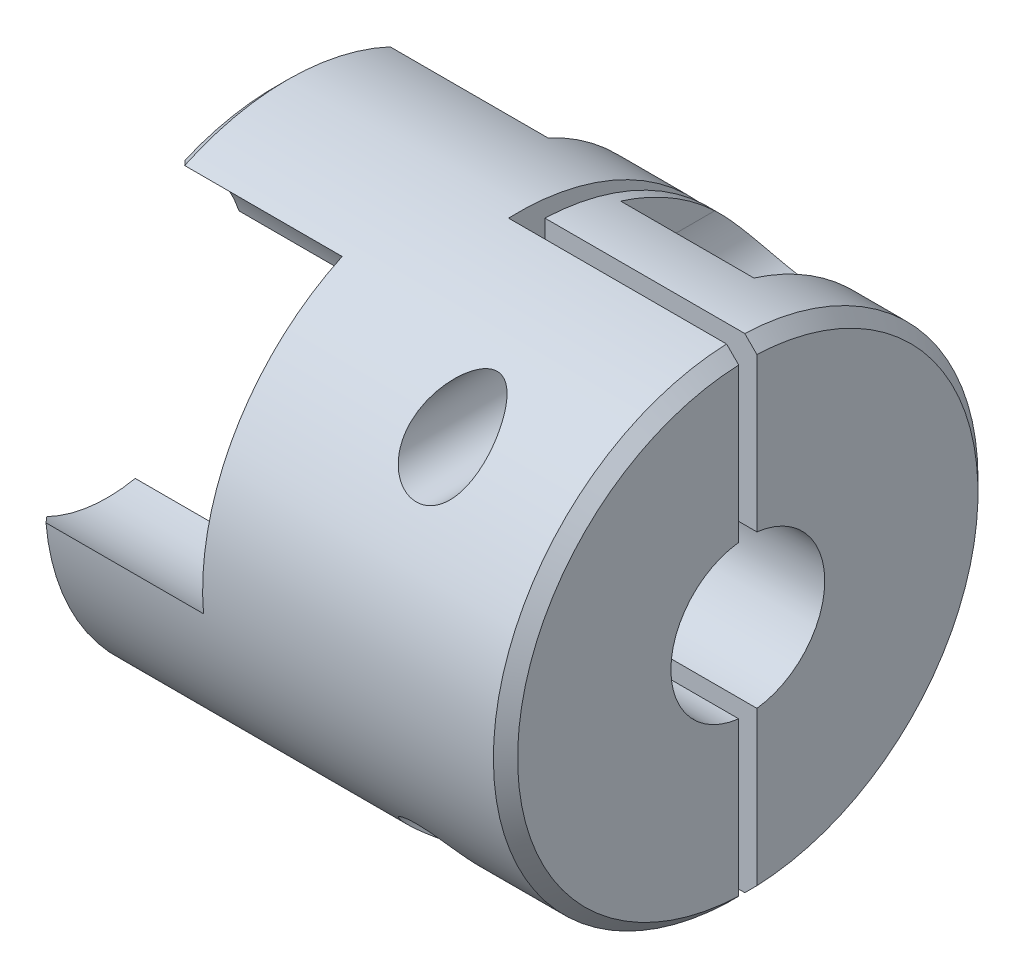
ISO-10303-21;
HEADER;
FILE_DESCRIPTION(('STEP AP214'),'2;1');
FILE_NAME('part.step','',(''),(''),'','','');
FILE_SCHEMA(('AUTOMOTIVE_DESIGN { 1 0 10303 214 1 1 1 1 }'));
ENDSEC;
DATA;
#1=APPLICATION_CONTEXT('core data for automotive mechanical design processes');
#2=APPLICATION_PROTOCOL_DEFINITION('international standard','automotive_design',2000,#1);
#3=PRODUCT_CONTEXT('',#1,'mechanical');
#4=PRODUCT('Part','Part','',(#3));
#5=PRODUCT_RELATED_PRODUCT_CATEGORY('part','',(#4));
#6=PRODUCT_DEFINITION_FORMATION('','',#4);
#7=PRODUCT_DEFINITION_CONTEXT('part definition',#1,'design');
#8=PRODUCT_DEFINITION('design','',#6,#7);
#9=PRODUCT_DEFINITION_SHAPE('','',#8);
#10=(LENGTH_UNIT() NAMED_UNIT(*) SI_UNIT(.MILLI.,.METRE.));
#11=(NAMED_UNIT(*) PLANE_ANGLE_UNIT() SI_UNIT($,.RADIAN.));
#12=(NAMED_UNIT(*) SI_UNIT($,.STERADIAN.) SOLID_ANGLE_UNIT());
#13=UNCERTAINTY_MEASURE_WITH_UNIT(LENGTH_MEASURE(1.E-05),#10,'distance_accuracy_value','');
#14=(GEOMETRIC_REPRESENTATION_CONTEXT(3) GLOBAL_UNCERTAINTY_ASSIGNED_CONTEXT((#13)) GLOBAL_UNIT_ASSIGNED_CONTEXT((#10,
#11,#12)) REPRESENTATION_CONTEXT('',''));
#15=CARTESIAN_POINT('',(0.,0.,0.));
#16=DIRECTION('',(0.,0.,1.));
#17=DIRECTION('',(1.,0.,0.));
#18=AXIS2_PLACEMENT_3D('',#15,#16,#17);
#19=CARTESIAN_POINT('',(0.,0.,0.));
#20=DIRECTION('',(1.,0.,0.));
#21=DIRECTION('',(0.,0.,-1.));
#22=AXIS2_PLACEMENT_3D('',#19,#20,#21);
#23=PLANE('',#22);
#24=CARTESIAN_POINT('',(0.,8.,-13.85640646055));
#25=DIRECTION('',(-1.,0.,0.));
#26=DIRECTION('',(0.,0.,1.));
#27=AXIS2_PLACEMENT_3D('',#24,#25,#26);
#28=CIRCLE('',#27,11.45);
#29=CARTESIAN_POINT('',(-7.37257477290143E-13,17.4829444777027,-7.43953307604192));
#30=VERTEX_POINT('',#29);
#31=CARTESIAN_POINT('',(0.,11.6205262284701,-2.99388880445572));
#32=VERTEX_POINT('',#31);
#33=EDGE_CURVE('P0_E132',#30,#32,#28,.F.);
#34=ORIENTED_EDGE('',*,*,#33,.T.);
#35=CARTESIAN_POINT('',(0.,0.,0.));
#36=DIRECTION('',(-1.,0.,0.));
#37=DIRECTION('',(0.,0.,1.));
#38=AXIS2_PLACEMENT_3D('',#35,#36,#37);
#39=CIRCLE('',#38,12.);
#40=CARTESIAN_POINT('',(0.,11.62052622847,2.99388880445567));
#41=VERTEX_POINT('',#40);
#42=EDGE_CURVE('P0_E19',#32,#41,#39,.F.);
#43=ORIENTED_EDGE('',*,*,#42,.T.);
#44=CARTESIAN_POINT('',(0.,8.,13.85640646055));
#45=DIRECTION('',(-1.,0.,0.));
#46=DIRECTION('',(0.,0.,1.));
#47=AXIS2_PLACEMENT_3D('',#44,#45,#46);
#48=CIRCLE('',#47,11.45);
#49=CARTESIAN_POINT('',(-7.37257477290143E-13,17.4829444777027,7.43953307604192));
#50=VERTEX_POINT('',#49);
#51=EDGE_CURVE('P0_E162',#41,#50,#48,.F.);
#52=ORIENTED_EDGE('',*,*,#51,.T.);
#53=CARTESIAN_POINT('',(-1.47451495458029E-12,0.,0.));
#54=DIRECTION('',(1.,0.,0.));
#55=DIRECTION('',(0.,0.,-1.));
#56=AXIS2_PLACEMENT_3D('',#53,#54,#55);
#57=CIRCLE('',#56,18.9999999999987);
#58=EDGE_CURVE('P0_E136',#30,#50,#57,.T.);
#59=ORIENTED_EDGE('',*,*,#58,.F.);
#60=EDGE_LOOP('',(#34,#43,#52,#59));
#61=FACE_BOUND('',#60,.T.);
#62=ADVANCED_FACE('P0_F16',(#61),#23,.F.);
#63=CARTESIAN_POINT('',(28.,14.5,0.750000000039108));
#64=DIRECTION('',(0.,0.,-1.));
#65=DIRECTION('',(-1.,0.,0.));
#66=AXIS2_PLACEMENT_3D('',#63,#64,#65);
#67=CONICAL_SURFACE('',#66,3.02499999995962,0.39269908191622);
#68=CARTESIAN_POINT('',(28.,14.5,0.750000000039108));
#69=DIRECTION('',(0.,0.,-1.));
#70=DIRECTION('',(-1.,0.,0.));
#71=AXIS2_PLACEMENT_3D('',#68,#69,#70);
#72=CIRCLE('',#71,3.02499999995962);
#73=CARTESIAN_POINT('',(24.9750000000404,14.5,0.750000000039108));
#74=VERTEX_POINT('',#73);
#75=EDGE_CURVE('P0_E185',#74,#74,#72,.T.);
#76=ORIENTED_EDGE('',*,*,#75,.T.);
#77=EDGE_LOOP('',(#76));
#78=FACE_BOUND('',#77,.T.);
#79=CARTESIAN_POINT('',(28.,14.5,0.8103553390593));
#80=DIRECTION('',(0.,0.,-1.));
#81=DIRECTION('',(-1.,0.,0.));
#82=AXIS2_PLACEMENT_3D('',#79,#80,#81);
#83=CIRCLE('',#82,3.);
#84=CARTESIAN_POINT('',(25.,14.5,0.8103553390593));
#85=VERTEX_POINT('',#84);
#86=EDGE_CURVE('P0_E181',#85,#85,#83,.F.);
#87=ORIENTED_EDGE('',*,*,#86,.T.);
#88=EDGE_LOOP('',(#87));
#89=FACE_BOUND('',#88,.T.);
#90=ADVANCED_FACE('P0_F513',(#78,#89),#67,.F.);
#91=CARTESIAN_POINT('',(39.,0.,0.));
#92=DIRECTION('',(1.,0.,0.));
#93=DIRECTION('',(0.,0.,-1.));
#94=AXIS2_PLACEMENT_3D('',#91,#92,#93);
#95=PLANE('',#94);
#96=DIRECTION('',(0.,1.,0.));
#97=VECTOR('',#96,1.);
#98=CARTESIAN_POINT('',(39.,-12.49724442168,0.75));
#99=LINE('',#98,#97);
#100=CARTESIAN_POINT('',(39.000000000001,-18.9851915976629,0.75));
#101=VERTEX_POINT('',#100);
#102=CARTESIAN_POINT('',(39.,-6.30555310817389,0.75));
#103=VERTEX_POINT('',#102);
#104=EDGE_CURVE('P0_E167',#101,#103,#99,.T.);
#105=ORIENTED_EDGE('',*,*,#104,.T.);
#106=CARTESIAN_POINT('',(39.,0.,0.));
#107=DIRECTION('',(-1.,0.,0.));
#108=DIRECTION('',(0.,0.,1.));
#109=AXIS2_PLACEMENT_3D('',#106,#107,#108);
#110=CIRCLE('',#109,6.35);
#111=CARTESIAN_POINT('',(39.,6.30555310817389,0.75));
#112=VERTEX_POINT('',#111);
#113=EDGE_CURVE('P0_E265',#103,#112,#110,.T.);
#114=ORIENTED_EDGE('',*,*,#113,.T.);
#115=DIRECTION('',(0.,1.,0.));
#116=VECTOR('',#115,1.);
#117=CARTESIAN_POINT('',(39.,-12.49724442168,0.75));
#118=LINE('',#117,#116);
#119=CARTESIAN_POINT('',(39.,18.9851915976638,0.75));
#120=VERTEX_POINT('',#119);
#121=EDGE_CURVE('P0_E179',#112,#120,#118,.T.);
#122=ORIENTED_EDGE('',*,*,#121,.T.);
#123=CARTESIAN_POINT('',(39.0000000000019,0.,0.));
#124=DIRECTION('',(-1.,0.,0.));
#125=DIRECTION('',(0.,0.,1.));
#126=AXIS2_PLACEMENT_3D('',#123,#124,#125);
#127=CIRCLE('',#126,18.9999999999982);
#128=EDGE_CURVE('P0_E296',#101,#120,#127,.T.);
#129=ORIENTED_EDGE('',*,*,#128,.F.);
#130=EDGE_LOOP('',(#105,#114,#122,#129));
#131=FACE_BOUND('',#130,.T.);
#132=ADVANCED_FACE('P0_F511',(#131),#95,.T.);
#133=CARTESIAN_POINT('',(0.,0.,0.));
#134=DIRECTION('',(1.,0.,0.));
#135=DIRECTION('',(0.,0.,-1.));
#136=AXIS2_PLACEMENT_3D('',#133,#134,#135);
#137=PLANE('',#136);
#138=CARTESIAN_POINT('',(0.,8.,13.85640646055));
#139=DIRECTION('',(-1.,0.,0.));
#140=DIRECTION('',(0.,0.,1.));
#141=AXIS2_PLACEMENT_3D('',#138,#139,#140);
#142=CIRCLE('',#141,11.45);
#143=CARTESIAN_POINT('',(1.03562991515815E-12,-2.29864760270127,18.8604405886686));
#144=VERTEX_POINT('',#143);
#145=CARTESIAN_POINT('',(0.,-3.21747935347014,11.560615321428));
#146=VERTEX_POINT('',#145);
#147=EDGE_CURVE('P0_E166',#144,#146,#142,.F.);
#148=ORIENTED_EDGE('',*,*,#147,.T.);
#149=CARTESIAN_POINT('',(0.,0.,0.));
#150=DIRECTION('',(-1.,0.,0.));
#151=DIRECTION('',(0.,0.,1.));
#152=AXIS2_PLACEMENT_3D('',#149,#150,#151);
#153=CIRCLE('',#152,12.);
#154=CARTESIAN_POINT('',(0.,-8.40304687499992,8.56672651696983));
#155=VERTEX_POINT('',#154);
#156=EDGE_CURVE('P0_E267',#146,#155,#153,.F.);
#157=ORIENTED_EDGE('',*,*,#156,.T.);
#158=CARTESIAN_POINT('',(0.,-16.,0.));
#159=DIRECTION('',(-1.,0.,0.));
#160=DIRECTION('',(0.,0.,1.));
#161=AXIS2_PLACEMENT_3D('',#158,#159,#160);
#162=CIRCLE('',#161,11.45);
#163=CARTESIAN_POINT('',(0.,-15.1842968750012,11.4209075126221));
#164=VERTEX_POINT('',#163);
#165=EDGE_CURVE('P0_E149',#155,#164,#162,.F.);
#166=ORIENTED_EDGE('',*,*,#165,.T.);
#167=CARTESIAN_POINT('',(2.07125983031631E-12,0.,0.));
#168=DIRECTION('',(1.,0.,0.));
#169=DIRECTION('',(0.,0.,-1.));
#170=AXIS2_PLACEMENT_3D('',#167,#168,#169);
#171=CIRCLE('',#170,19.0000000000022);
#172=EDGE_CURVE('P0_E165',#144,#164,#171,.T.);
#173=ORIENTED_EDGE('',*,*,#172,.F.);
#174=EDGE_LOOP('',(#148,#157,#166,#173));
#175=FACE_BOUND('',#174,.T.);
#176=ADVANCED_FACE('P0_F272',(#175),#137,.F.);
#177=CARTESIAN_POINT('',(14.,0.,0.));
#178=DIRECTION('',(-1.,0.,0.));
#179=DIRECTION('',(0.,0.,1.));
#180=AXIS2_PLACEMENT_3D('',#177,#178,#179);
#181=CYLINDRICAL_SURFACE('',#180,12.);
#182=ORIENTED_EDGE('',*,*,#42,.F.);
#183=DIRECTION('',(-1.,0.,0.));
#184=VECTOR('',#183,1.);
#185=CARTESIAN_POINT('',(14.,11.6205262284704,-2.99388880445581));
#186=LINE('',#185,#184);
#187=CARTESIAN_POINT('',(14.,11.6205262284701,-2.99388880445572));
#188=VERTEX_POINT('',#187);
#189=EDGE_CURVE('P0_E140',#32,#188,#186,.F.);
#190=ORIENTED_EDGE('',*,*,#189,.T.);
#191=CARTESIAN_POINT('',(14.,0.,0.));
#192=DIRECTION('',(-1.,0.,0.));
#193=DIRECTION('',(0.,0.,1.));
#194=AXIS2_PLACEMENT_3D('',#191,#192,#193);
#195=CIRCLE('',#194,12.);
#196=CARTESIAN_POINT('',(14.,11.62052622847,2.99388880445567));
#197=VERTEX_POINT('',#196);
#198=EDGE_CURVE('P0_E335',#197,#188,#195,.T.);
#199=ORIENTED_EDGE('',*,*,#198,.F.);
#200=DIRECTION('',(-1.,0.,0.));
#201=VECTOR('',#200,1.);
#202=CARTESIAN_POINT('',(14.,11.6205262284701,2.99388880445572));
#203=LINE('',#202,#201);
#204=EDGE_CURVE('P0_E147',#197,#41,#203,.T.);
#205=ORIENTED_EDGE('',*,*,#204,.T.);
#206=EDGE_LOOP('',(#182,#190,#199,#205));
#207=FACE_BOUND('',#206,.T.);
#208=ADVANCED_FACE('P0_F144',(#207),#181,.F.);
#209=CARTESIAN_POINT('',(14.,0.,0.));
#210=DIRECTION('',(-1.,0.,0.));
#211=DIRECTION('',(0.,0.,1.));
#212=AXIS2_PLACEMENT_3D('',#209,#210,#211);
#213=CYLINDRICAL_SURFACE('',#212,12.);
#214=CARTESIAN_POINT('',(14.,0.,0.));
#215=DIRECTION('',(-1.,0.,0.));
#216=DIRECTION('',(0.,0.,1.));
#217=AXIS2_PLACEMENT_3D('',#214,#215,#216);
#218=CIRCLE('',#217,12.);
#219=CARTESIAN_POINT('',(14.,-8.40304687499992,8.56672651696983));
#220=VERTEX_POINT('',#219);
#221=CARTESIAN_POINT('',(14.,-3.21747935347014,11.560615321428));
#222=VERTEX_POINT('',#221);
#223=EDGE_CURVE('P0_E344',#220,#222,#218,.T.);
#224=ORIENTED_EDGE('',*,*,#223,.F.);
#225=DIRECTION('',(-1.,0.,0.));
#226=VECTOR('',#225,1.);
#227=CARTESIAN_POINT('',(14.,-8.40304687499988,8.56672651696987));
#228=LINE('',#227,#226);
#229=EDGE_CURVE('P0_E159',#155,#220,#228,.F.);
#230=ORIENTED_EDGE('',*,*,#229,.F.);
#231=ORIENTED_EDGE('',*,*,#156,.F.);
#232=DIRECTION('',(-1.,0.,0.));
#233=VECTOR('',#232,1.);
#234=CARTESIAN_POINT('',(14.,-3.21747935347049,11.5606153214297));
#235=LINE('',#234,#233);
#236=EDGE_CURVE('P0_E163',#146,#222,#235,.F.);
#237=ORIENTED_EDGE('',*,*,#236,.T.);
#238=EDGE_LOOP('',(#224,#230,#231,#237));
#239=FACE_BOUND('',#238,.T.);
#240=ADVANCED_FACE('P0_F484',(#239),#213,.F.);
#241=CARTESIAN_POINT('',(-28.8,0.,0.));
#242=DIRECTION('',(-1.,0.,0.));
#243=DIRECTION('',(0.,0.,1.));
#244=AXIS2_PLACEMENT_3D('',#241,#242,#243);
#245=CYLINDRICAL_SURFACE('',#244,6.35);
#246=DIRECTION('',(1.,0.,0.));
#247=VECTOR('',#246,1.);
#248=CARTESIAN_POINT('',(51.50253033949,-6.305553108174,0.75));
#249=LINE('',#248,#247);
#250=CARTESIAN_POINT('',(20.00253033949,-6.30555310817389,0.75));
#251=VERTEX_POINT('',#250);
#252=EDGE_CURVE('P0_E172',#103,#251,#249,.F.);
#253=ORIENTED_EDGE('',*,*,#252,.T.);
#254=CARTESIAN_POINT('',(20.00253033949,0.,0.));
#255=DIRECTION('',(-1.,0.,0.));
#256=DIRECTION('',(0.,0.,1.));
#257=AXIS2_PLACEMENT_3D('',#254,#255,#256);
#258=CIRCLE('',#257,6.35);
#259=CARTESIAN_POINT('',(20.00253033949,6.30555310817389,0.75));
#260=VERTEX_POINT('',#259);
#261=EDGE_CURVE('P0_E184',#251,#260,#258,.F.);
#262=ORIENTED_EDGE('',*,*,#261,.T.);
#263=DIRECTION('',(1.,0.,0.));
#264=VECTOR('',#263,1.);
#265=CARTESIAN_POINT('',(51.50253033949,6.305553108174,0.75));
#266=LINE('',#265,#264);
#267=EDGE_CURVE('P0_E176',#260,#112,#266,.T.);
#268=ORIENTED_EDGE('',*,*,#267,.T.);
#269=ORIENTED_EDGE('',*,*,#113,.F.);
#270=EDGE_LOOP('',(#253,#262,#268,#269));
#271=FACE_BOUND('',#270,.T.);
#272=CARTESIAN_POINT('',(14.,0.,0.));
#273=DIRECTION('',(-1.,0.,0.));
#274=DIRECTION('',(0.,0.,1.));
#275=AXIS2_PLACEMENT_3D('',#272,#273,#274);
#276=CIRCLE('',#275,6.35);
#277=CARTESIAN_POINT('',(14.,0.,6.35));
#278=VERTEX_POINT('',#277);
#279=EDGE_CURVE('P0_E347',#278,#278,#276,.F.);
#280=ORIENTED_EDGE('',*,*,#279,.F.);
#281=EDGE_LOOP('',(#280));
#282=FACE_BOUND('',#281,.T.);
#283=ADVANCED_FACE('P0_F496',(#271,#282),#245,.F.);
#284=CARTESIAN_POINT('',(14.,0.,0.));
#285=DIRECTION('',(-1.,0.,0.));
#286=DIRECTION('',(0.,0.,1.));
#287=AXIS2_PLACEMENT_3D('',#284,#285,#286);
#288=CYLINDRICAL_SURFACE('',#287,12.);
#289=CARTESIAN_POINT('',(14.,0.,0.));
#290=DIRECTION('',(-1.,0.,0.));
#291=DIRECTION('',(0.,0.,1.));
#292=AXIS2_PLACEMENT_3D('',#289,#290,#291);
#293=CIRCLE('',#292,12.);
#294=CARTESIAN_POINT('',(14.,-3.21747935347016,-11.5606153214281));
#295=VERTEX_POINT('',#294);
#296=CARTESIAN_POINT('',(14.,-8.40304687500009,-8.56672651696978));
#297=VERTEX_POINT('',#296);
#298=EDGE_CURVE('P0_E338',#295,#297,#293,.T.);
#299=ORIENTED_EDGE('',*,*,#298,.F.);
#300=DIRECTION('',(-1.,0.,0.));
#301=VECTOR('',#300,1.);
#302=CARTESIAN_POINT('',(14.,-3.21747935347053,-11.5606153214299));
#303=LINE('',#302,#301);
#304=CARTESIAN_POINT('',(0.,-3.21747935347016,-11.5606153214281));
#305=VERTEX_POINT('',#304);
#306=EDGE_CURVE('P0_E387',#295,#305,#303,.T.);
#307=ORIENTED_EDGE('',*,*,#306,.T.);
#308=CARTESIAN_POINT('',(0.,0.,0.));
#309=DIRECTION('',(-1.,0.,0.));
#310=DIRECTION('',(0.,0.,1.));
#311=AXIS2_PLACEMENT_3D('',#308,#309,#310);
#312=CIRCLE('',#311,12.);
#313=CARTESIAN_POINT('',(0.,-8.40304687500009,-8.56672651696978));
#314=VERTEX_POINT('',#313);
#315=EDGE_CURVE('P0_E141',#305,#314,#312,.T.);
#316=ORIENTED_EDGE('',*,*,#315,.T.);
#317=DIRECTION('',(-1.,0.,0.));
#318=VECTOR('',#317,1.);
#319=CARTESIAN_POINT('',(14.,-8.40304687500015,-8.56672651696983));
#320=LINE('',#319,#318);
#321=EDGE_CURVE('P0_E353',#314,#297,#320,.F.);
#322=ORIENTED_EDGE('',*,*,#321,.T.);
#323=EDGE_LOOP('',(#299,#307,#316,#322));
#324=FACE_BOUND('',#323,.T.);
#325=ADVANCED_FACE('P0_F401',(#324),#288,.F.);
#326=CARTESIAN_POINT('',(0.,0.,0.));
#327=DIRECTION('',(1.,0.,0.));
#328=DIRECTION('',(0.,0.,-1.));
#329=AXIS2_PLACEMENT_3D('',#326,#327,#328);
#330=PLANE('',#329);
#331=CARTESIAN_POINT('',(0.,-16.,0.));
#332=DIRECTION('',(-1.,0.,0.));
#333=DIRECTION('',(0.,0.,1.));
#334=AXIS2_PLACEMENT_3D('',#331,#332,#333);
#335=CIRCLE('',#334,11.45);
#336=CARTESIAN_POINT('',(-3.34801630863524E-13,-15.1842968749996,-11.4209075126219));
#337=VERTEX_POINT('',#336);
#338=EDGE_CURVE('P0_E350',#337,#314,#335,.F.);
#339=ORIENTED_EDGE('',*,*,#338,.T.);
#340=ORIENTED_EDGE('',*,*,#315,.F.);
#341=CARTESIAN_POINT('',(0.,8.,-13.85640646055));
#342=DIRECTION('',(-1.,0.,0.));
#343=DIRECTION('',(0.,0.,1.));
#344=AXIS2_PLACEMENT_3D('',#341,#342,#343);
#345=CIRCLE('',#344,11.45);
#346=CARTESIAN_POINT('',(-3.34801630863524E-13,-2.29864760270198,-18.8604405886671));
#347=VERTEX_POINT('',#346);
#348=EDGE_CURVE('P0_E385',#305,#347,#345,.F.);
#349=ORIENTED_EDGE('',*,*,#348,.T.);
#350=CARTESIAN_POINT('',(-6.69603261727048E-13,0.,0.));
#351=DIRECTION('',(1.,0.,0.));
#352=DIRECTION('',(0.,0.,-1.));
#353=AXIS2_PLACEMENT_3D('',#350,#351,#352);
#354=CIRCLE('',#353,18.9999999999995);
#355=EDGE_CURVE('P0_E357',#337,#347,#354,.T.);
#356=ORIENTED_EDGE('',*,*,#355,.F.);
#357=EDGE_LOOP('',(#339,#340,#349,#356));
#358=FACE_BOUND('',#357,.T.);
#359=ADVANCED_FACE('P0_F420',(#358),#330,.F.);
#360=CARTESIAN_POINT('',(14.,8.,-13.85640646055));
#361=DIRECTION('',(-1.,0.,0.));
#362=DIRECTION('',(0.,0.,1.));
#363=AXIS2_PLACEMENT_3D('',#360,#361,#362);
#364=CYLINDRICAL_SURFACE('',#363,11.45);
#365=DIRECTION('',(-1.,0.,0.));
#366=VECTOR('',#365,1.);
#367=CARTESIAN_POINT('',(39.,18.1113690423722,-8.48400326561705));
#368=LINE('',#367,#366);
#369=CARTESIAN_POINT('',(14.,18.1113690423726,-8.48400326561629));
#370=VERTEX_POINT('',#369);
#371=CARTESIAN_POINT('',(1.00000000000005,18.1113690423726,-8.48400326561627));
#372=VERTEX_POINT('',#371);
#373=EDGE_CURVE('P0_E397',#370,#372,#368,.T.);
#374=ORIENTED_EDGE('',*,*,#373,.F.);
#375=CARTESIAN_POINT('',(14.,8.,-13.85640646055));
#376=DIRECTION('',(-1.,0.,0.));
#377=DIRECTION('',(0.,0.,1.));
#378=AXIS2_PLACEMENT_3D('',#375,#376,#377);
#379=CIRCLE('',#378,11.45);
#380=EDGE_CURVE('P0_E152',#188,#370,#379,.T.);
#381=ORIENTED_EDGE('',*,*,#380,.F.);
#382=ORIENTED_EDGE('',*,*,#189,.F.);
#383=ORIENTED_EDGE('',*,*,#33,.F.);
#384=CARTESIAN_POINT('',(1.0000000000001,18.1113690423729,-8.48400326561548));
#385=CARTESIAN_POINT('',(0.917909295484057,18.0631923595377,-8.3933301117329));
#386=CARTESIAN_POINT('',(0.835486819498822,18.0139208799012,-8.30354016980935));
#387=CARTESIAN_POINT('',(0.670040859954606,17.9132769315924,-8.1257986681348));
#388=CARTESIAN_POINT('',(0.587017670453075,17.8619054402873,-8.03784628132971));
#389=CARTESIAN_POINT('',(0.420357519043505,17.7571058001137,-7.86376865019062));
#390=CARTESIAN_POINT('',(0.33672055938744,17.7036776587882,-7.7776433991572));
#391=CARTESIAN_POINT('',(0.168817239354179,17.5948035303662,-7.60720846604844));
#392=CARTESIAN_POINT('',(0.0845506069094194,17.5393566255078,-7.52289963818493));
#393=CARTESIAN_POINT('',(-6.51596830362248E-13,17.4829444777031,-7.43953307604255));
#394=B_SPLINE_CURVE_WITH_KNOTS('',3,(#384,#385,#386,#387,#388,#389,#390,#391,#392,#393),
.UNSPECIFIED.,.F.,.F.,(4,2,2,2,4),(0.,0.394368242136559,0.788554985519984,1.1827402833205,
1.57710707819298),.UNSPECIFIED.);
#395=EDGE_CURVE('P0_E155',#372,#30,#394,.T.);
#396=ORIENTED_EDGE('',*,*,#395,.F.);
#397=EDGE_LOOP('',(#374,#381,#382,#383,#396));
#398=FACE_BOUND('',#397,.T.);
#399=ADVANCED_FACE('P0_F151',(#398),#364,.F.);
#400=CARTESIAN_POINT('',(0.999999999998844,0.,0.));
#401=DIRECTION('',(1.,0.,0.));
#402=DIRECTION('',(0.,0.,-1.));
#403=AXIS2_PLACEMENT_3D('',#400,#401,#402);
#404=CONICAL_SURFACE('',#403,19.9999999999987,0.7853981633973);
#405=CARTESIAN_POINT('',(1.,0.,0.));
#406=DIRECTION('',(-1.,0.,0.));
#407=DIRECTION('',(0.,0.,1.));
#408=AXIS2_PLACEMENT_3D('',#405,#406,#407);
#409=CIRCLE('',#408,20.);
#410=CARTESIAN_POINT('',(1.00000000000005,18.1113690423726,8.48400326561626));
#411=VERTEX_POINT('',#410);
#412=EDGE_CURVE('P0_E465',#372,#411,#409,.F.);
#413=ORIENTED_EDGE('',*,*,#412,.F.);
#414=ORIENTED_EDGE('',*,*,#395,.T.);
#415=ORIENTED_EDGE('',*,*,#58,.T.);
#416=CARTESIAN_POINT('',(-6.51248798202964E-13,17.4829444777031,7.43953307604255));
#417=CARTESIAN_POINT('',(0.08455060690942,17.5393566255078,7.52289963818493));
#418=CARTESIAN_POINT('',(0.16881723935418,17.5948035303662,7.60720846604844));
#419=CARTESIAN_POINT('',(0.33672055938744,17.7036776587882,7.7776433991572));
#420=CARTESIAN_POINT('',(0.420357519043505,17.7571058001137,7.86376865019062));
#421=CARTESIAN_POINT('',(0.587017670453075,17.8619054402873,8.03784628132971));
#422=CARTESIAN_POINT('',(0.670040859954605,17.9132769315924,8.1257986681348));
#423=CARTESIAN_POINT('',(0.835486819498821,18.0139208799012,8.30354016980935));
#424=CARTESIAN_POINT('',(0.917909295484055,18.0631923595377,8.3933301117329));
#425=CARTESIAN_POINT('',(1.0000000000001,18.1113690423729,8.48400326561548));
#426=B_SPLINE_CURVE_WITH_KNOTS('',3,(#416,#417,#418,#419,#420,#421,#422,#423,#424,#425),
.UNSPECIFIED.,.F.,.F.,(4,2,2,2,4),(0.,0.394366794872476,0.788552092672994,1.18273883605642,
1.57710707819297),.UNSPECIFIED.);
#427=EDGE_CURVE('P0_E180',#50,#411,#426,.T.);
#428=ORIENTED_EDGE('',*,*,#427,.T.);
#429=EDGE_LOOP('',(#413,#414,#415,#428));
#430=FACE_BOUND('',#429,.T.);
#431=ADVANCED_FACE('P0_F251',(#430),#404,.T.);
#432=CARTESIAN_POINT('',(14.,8.,13.85640646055));
#433=DIRECTION('',(-1.,0.,0.));
#434=DIRECTION('',(0.,0.,1.));
#435=AXIS2_PLACEMENT_3D('',#432,#433,#434);
#436=CYLINDRICAL_SURFACE('',#435,11.45);
#437=ORIENTED_EDGE('',*,*,#51,.F.);
#438=ORIENTED_EDGE('',*,*,#204,.F.);
#439=CARTESIAN_POINT('',(14.,8.,13.85640646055));
#440=DIRECTION('',(-1.,0.,0.));
#441=DIRECTION('',(0.,0.,1.));
#442=AXIS2_PLACEMENT_3D('',#439,#440,#441);
#443=CIRCLE('',#442,11.45);
#444=CARTESIAN_POINT('',(14.,18.1113690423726,8.48400326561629));
#445=VERTEX_POINT('',#444);
#446=EDGE_CURVE('P0_E332',#445,#197,#443,.T.);
#447=ORIENTED_EDGE('',*,*,#446,.F.);
#448=DIRECTION('',(-1.,0.,0.));
#449=VECTOR('',#448,1.);
#450=CARTESIAN_POINT('',(39.,18.1113690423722,8.48400326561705));
#451=LINE('',#450,#449);
#452=EDGE_CURVE('P0_E464',#411,#445,#451,.F.);
#453=ORIENTED_EDGE('',*,*,#452,.F.);
#454=ORIENTED_EDGE('',*,*,#427,.F.);
#455=EDGE_LOOP('',(#437,#438,#447,#453,#454));
#456=FACE_BOUND('',#455,.T.);
#457=ADVANCED_FACE('P0_F230',(#456),#436,.F.);
#458=CARTESIAN_POINT('',(51.50253033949,-12.49724442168,0.75));
#459=DIRECTION('',(0.,0.,1.));
#460=DIRECTION('',(1.,0.,0.));
#461=AXIS2_PLACEMENT_3D('',#458,#459,#460);
#462=PLANE('',#461);
#463=ORIENTED_EDGE('',*,*,#75,.F.);
#464=EDGE_LOOP('',(#463));
#465=FACE_BOUND('',#464,.T.);
#466=DIRECTION('',(-1.,0.,0.));
#467=VECTOR('',#466,1.);
#468=CARTESIAN_POINT('',(39.,19.9859325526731,0.750000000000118));
#469=LINE('',#468,#467);
#470=CARTESIAN_POINT('',(38.,19.9859325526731,0.750000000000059));
#471=VERTEX_POINT('',#470);
#472=CARTESIAN_POINT('',(20.00253033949,19.9859325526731,0.750000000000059));
#473=VERTEX_POINT('',#472);
#474=EDGE_CURVE('P0_E214',#471,#473,#469,.T.);
#475=ORIENTED_EDGE('',*,*,#474,.F.);
#476=CARTESIAN_POINT('',(39.0000000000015,18.9851915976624,0.75));
#477=CARTESIAN_POINT('',(38.8333365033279,19.1519849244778,0.75));
#478=CARTESIAN_POINT('',(38.6666714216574,19.31877666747,0.75));
#479=CARTESIAN_POINT('',(38.3333380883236,19.6523569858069,0.75));
#480=CARTESIAN_POINT('',(38.1666698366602,19.8191455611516,0.75));
#481=CARTESIAN_POINT('',(37.9999999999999,19.9859325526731,0.75));
#482=B_SPLINE_CURVE_WITH_KNOTS('',3,(#476,#477,#478,#479,#480,#481),.UNSPECIFIED.,.F.,.F.,(4,2,
4),(0.,0.707368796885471,1.41473759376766),.UNSPECIFIED.);
#483=EDGE_CURVE('P0_E187',#120,#471,#482,.T.);
#484=ORIENTED_EDGE('',*,*,#483,.F.);
#485=ORIENTED_EDGE('',*,*,#121,.F.);
#486=ORIENTED_EDGE('',*,*,#267,.F.);
#487=DIRECTION('',(0.,1.,0.));
#488=VECTOR('',#487,1.);
#489=CARTESIAN_POINT('',(20.00253033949,-12.49724442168,0.75));
#490=LINE('',#489,#488);
#491=EDGE_CURVE('P0_E175',#260,#473,#490,.T.);
#492=ORIENTED_EDGE('',*,*,#491,.T.);
#493=EDGE_LOOP('',(#475,#484,#485,#486,#492));
#494=FACE_BOUND('',#493,.T.);
#495=ADVANCED_FACE('P0_F224',(#465,#494),#462,.F.);
#496=CARTESIAN_POINT('',(28.,14.5,0.75));
#497=DIRECTION('',(0.,0.,-1.));
#498=DIRECTION('',(-1.,0.,0.));
#499=AXIS2_PLACEMENT_3D('',#496,#497,#498);
#500=CYLINDRICAL_SURFACE('',#499,3.);
#501=ORIENTED_EDGE('',*,*,#86,.F.);
#502=EDGE_LOOP('',(#501));
#503=FACE_BOUND('',#502,.T.);
#504=CARTESIAN_POINT('',(31.,14.499999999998,13.7749773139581));
#505=CARTESIAN_POINT('',(31.0000036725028,14.3256015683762,13.9585492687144));
#506=CARTESIAN_POINT('',(30.9848346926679,14.1476033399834,14.1389025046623));
#507=CARTESIAN_POINT('',(30.9200100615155,13.7880618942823,14.4897301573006));
#508=CARTESIAN_POINT('',(30.8703761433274,13.6065209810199,14.6602107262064));
#509=CARTESIAN_POINT('',(30.7428088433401,13.2737928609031,14.9615742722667));
#510=CARTESIAN_POINT('',(30.67051811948,13.1223005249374,15.0944794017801));
#511=CARTESIAN_POINT('',(30.4954174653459,12.8259606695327,15.3470669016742));
#512=CARTESIAN_POINT('',(30.3926438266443,12.6811054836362,15.4667647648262));
#513=CARTESIAN_POINT('',(30.1770640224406,12.4305926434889,15.6684827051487));
#514=CARTESIAN_POINT('',(30.0696256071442,12.3226394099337,15.7533772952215));
#515=CARTESIAN_POINT('',(29.8335383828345,12.1204635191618,15.9094513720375));
#516=CARTESIAN_POINT('',(29.7048949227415,12.0262374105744,15.980634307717));
#517=CARTESIAN_POINT('',(29.4970711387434,11.8989439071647,16.0753848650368));
#518=CARTESIAN_POINT('',(29.4249453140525,11.8586980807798,16.1050752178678));
#519=CARTESIAN_POINT('',(29.2762730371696,11.7837446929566,16.1599972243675));
#520=CARTESIAN_POINT('',(29.1997289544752,11.7490341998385,16.1852312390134));
#521=CARTESIAN_POINT('',(29.0427908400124,11.6857968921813,16.2309482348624));
#522=CARTESIAN_POINT('',(28.962398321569,11.6572676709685,16.2514330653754));
#523=CARTESIAN_POINT('',(28.7984862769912,11.6069424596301,16.2874133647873));
#524=CARTESIAN_POINT('',(28.7149673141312,11.5851452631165,16.3029097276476));
#525=CARTESIAN_POINT('',(28.4847792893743,11.5357051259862,16.3379633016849));
#526=CARTESIAN_POINT('',(28.3357281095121,11.515058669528,16.3524783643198));
#527=CARTESIAN_POINT('',(28.0356439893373,11.4964454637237,16.3655698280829));
#528=CARTESIAN_POINT('',(27.8846121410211,11.4984667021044,16.364154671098));
#529=CARTESIAN_POINT('',(27.5970994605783,11.5239494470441,16.3462161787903));
#530=CARTESIAN_POINT('',(27.4603937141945,11.5457479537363,16.3308646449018));
#531=CARTESIAN_POINT('',(27.1932673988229,11.6072552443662,16.2872046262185));
#532=CARTESIAN_POINT('',(27.0628466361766,11.6469634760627,16.2588965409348));
#533=CARTESIAN_POINT('',(26.808582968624,11.7432952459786,16.1894593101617));
#534=CARTESIAN_POINT('',(26.6849493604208,11.8002734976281,16.1480604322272));
#535=CARTESIAN_POINT('',(26.4498141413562,11.9280645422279,16.0538956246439));
#536=CARTESIAN_POINT('',(26.3383157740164,11.9988810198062,16.0011266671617));
#537=CARTESIAN_POINT('',(26.1179431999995,12.1594166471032,15.8795374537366));
#538=CARTESIAN_POINT('',(26.0105562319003,12.2503370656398,15.8096169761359));
#539=CARTESIAN_POINT('',(25.8130523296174,12.4417916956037,15.6593959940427));
#540=CARTESIAN_POINT('',(25.7229480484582,12.5423328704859,15.5790879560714));
#541=CARTESIAN_POINT('',(25.5219810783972,12.7980161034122,15.3703940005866));
#542=CARTESIAN_POINT('',(25.4209307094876,12.9568190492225,15.2370089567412));
#543=CARTESIAN_POINT('',(25.2532011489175,13.280007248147,14.9561847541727));
#544=CARTESIAN_POINT('',(25.1865790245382,13.4444012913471,14.8087227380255));
#545=CARTESIAN_POINT('',(25.0886141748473,13.7592699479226,14.5163622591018));
#546=CARTESIAN_POINT('',(25.0547834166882,13.9097568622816,14.3722840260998));
#547=CARTESIAN_POINT('',(25.0104865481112,14.2076450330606,14.0778778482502));
#548=CARTESIAN_POINT('',(24.9999996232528,14.3550489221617,13.9275555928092));
#549=CARTESIAN_POINT('',(25.0000003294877,14.6267682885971,13.6415385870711));
#550=CARTESIAN_POINT('',(25.0080219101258,14.7516605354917,13.506374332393));
#551=CARTESIAN_POINT('',(25.0388573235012,14.996906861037,13.2335347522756));
#552=CARTESIAN_POINT('',(25.0616786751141,15.1172586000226,13.0958581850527));
#553=CARTESIAN_POINT('',(25.1213263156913,15.3533091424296,12.8183175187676));
#554=CARTESIAN_POINT('',(25.1582243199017,15.468980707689,12.6784457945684));
#555=CARTESIAN_POINT('',(25.2453946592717,15.6944701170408,12.3982232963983));
#556=CARTESIAN_POINT('',(25.2956635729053,15.8042894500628,12.2578726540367));
#557=CARTESIAN_POINT('',(25.4107888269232,16.0203102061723,11.9742315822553));
#558=CARTESIAN_POINT('',(25.4759775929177,16.1263531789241,11.8309550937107));
#559=CARTESIAN_POINT('',(25.6205458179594,16.3313798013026,11.5462896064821));
#560=CARTESIAN_POINT('',(25.6999358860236,16.4303580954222,11.4049021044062));
#561=CARTESIAN_POINT('',(25.8732547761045,16.6197480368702,11.1270859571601));
#562=CARTESIAN_POINT('',(25.9670792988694,16.7102141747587,10.990629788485));
#563=CARTESIAN_POINT('',(26.1714020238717,16.8820263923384,10.7248341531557));
#564=CARTESIAN_POINT('',(26.2818679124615,16.9633896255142,10.5954815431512));
#565=CARTESIAN_POINT('',(26.4779383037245,17.0867549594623,10.3947652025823));
#566=CARTESIAN_POINT('',(26.5575739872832,17.1321656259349,10.3196836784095));
#567=CARTESIAN_POINT('',(26.7258220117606,17.2176065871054,10.1764903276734));
#568=CARTESIAN_POINT('',(26.8144427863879,17.2576317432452,10.108385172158));
#569=CARTESIAN_POINT('',(27.0026123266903,17.3311743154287,9.9817740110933));
#570=CARTESIAN_POINT('',(27.1022750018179,17.3646116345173,9.92338734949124));
#571=CARTESIAN_POINT('',(27.3117933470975,17.4219954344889,9.82229492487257));
#572=CARTESIAN_POINT('',(27.4216176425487,17.4459699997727,9.7795427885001));
#573=CARTESIAN_POINT('',(27.6158626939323,17.4764192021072,9.72499103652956));
#574=CARTESIAN_POINT('',(27.6982709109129,17.485965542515,9.70778842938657));
#575=CARTESIAN_POINT('',(27.8652212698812,17.4981351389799,9.68583679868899));
#576=CARTESIAN_POINT('',(27.9497612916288,17.5007650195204,9.68107585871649));
#577=CARTESIAN_POINT('',(28.1185418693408,17.4988461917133,9.6845435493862));
#578=CARTESIAN_POINT('',(28.202782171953,17.4942924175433,9.69278134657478));
#579=CARTESIAN_POINT('',(28.3685419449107,17.4784447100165,9.72132841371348));
#580=CARTESIAN_POINT('',(28.450058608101,17.4671440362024,9.74164975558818));
#581=CARTESIAN_POINT('',(28.6354514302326,17.4339071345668,9.80103979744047));
#582=CARTESIAN_POINT('',(28.7376130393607,17.4096708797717,9.84411723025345));
#583=CARTESIAN_POINT('',(28.9328554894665,17.3531006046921,9.9434980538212));
#584=CARTESIAN_POINT('',(29.0259139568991,17.3207472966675,9.99983292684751));
#585=CARTESIAN_POINT('',(29.1877443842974,17.2559895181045,10.1110947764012));
#586=CARTESIAN_POINT('',(29.2579318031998,17.2245635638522,10.1645770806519));
#587=CARTESIAN_POINT('',(29.3927325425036,17.1581846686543,10.276230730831));
#588=CARTESIAN_POINT('',(29.4573420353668,17.1232293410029,10.3344052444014));
#589=CARTESIAN_POINT('',(29.581548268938,17.0502748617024,10.4543323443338));
#590=CARTESIAN_POINT('',(29.6411351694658,17.0122700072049,10.516091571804));
#591=CARTESIAN_POINT('',(29.7556244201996,16.9336398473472,10.642244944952));
#592=CARTESIAN_POINT('',(29.8105251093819,16.8930136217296,10.706640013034));
#593=CARTESIAN_POINT('',(29.9566437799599,16.7772269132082,10.8877674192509));
#594=CARTESIAN_POINT('',(30.043273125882,16.6995636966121,11.0066173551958));
#595=CARTESIAN_POINT('',(30.2045594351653,16.5378787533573,11.2480994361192));
#596=CARTESIAN_POINT('',(30.2792076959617,16.4538524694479,11.3707342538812));
#597=CARTESIAN_POINT('',(30.4174407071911,16.2799785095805,11.6183133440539));
#598=CARTESIAN_POINT('',(30.4810134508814,16.1901246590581,11.7432599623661));
#599=CARTESIAN_POINT('',(30.5974050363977,16.0051320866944,11.9941670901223));
#600=CARTESIAN_POINT('',(30.6502267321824,15.9099947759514,12.1201273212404));
#601=CARTESIAN_POINT('',(30.7464070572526,15.712284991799,12.3754118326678));
#602=CARTESIAN_POINT('',(30.7894925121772,15.6095853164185,12.5047406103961));
#603=CARTESIAN_POINT('',(30.8642058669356,15.3993185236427,12.7627856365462));
#604=CARTESIAN_POINT('',(30.8958321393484,15.2917507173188,12.8915017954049));
#605=CARTESIAN_POINT('',(30.947048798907,15.0723395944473,13.1473541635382));
#606=CARTESIAN_POINT('',(30.966657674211,14.9605031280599,13.2744925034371));
#607=CARTESIAN_POINT('',(30.9931302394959,14.7329866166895,13.5265646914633));
#608=CARTESIAN_POINT('',(30.9999975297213,14.6173076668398,13.6514991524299));
#609=CARTESIAN_POINT('',(31.,14.499999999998,13.7749773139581));
#610=B_SPLINE_CURVE_WITH_KNOTS('',3,(#504,#505,#506,#507,#508,#509,#510,#511,#512,#513,#514,
#515,#516,#517,#518,#519,#520,#521,#522,#523,#524,#525,#526,#527,#528,#529,#530,#531,#532,#533,
#534,#535,#536,#537,#538,#539,#540,#541,#542,#543,#544,#545,#546,#547,#548,#549,#550,#551,#552,
#553,#554,#555,#556,#557,#558,#559,#560,#561,#562,#563,#564,#565,#566,#567,#568,#569,#570,#571,
#572,#573,#574,#575,#576,#577,#578,#579,#580,#581,#582,#583,#584,#585,#586,#587,#588,#589,#590,
#591,#592,#593,#594,#595,#596,#597,#598,#599,#600,#601,#602,#603,#604,#605,#606,#607,#608,#609),
.UNSPECIFIED.,.T.,.F.,(4,2,2,2,2,2,2,2,2,2,2,2,2,2,2,2,2,2,2,2,2,2,2,2,2,2,2,2,2,2,2,2,2,2,2,2,
2,2,2,2,2,2,2,2,2,2,2,2,2,2,2,2,4),(0.,0.759258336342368,1.51803832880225,2.15810135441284,
2.79740538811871,3.31851395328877,3.83949127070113,4.10246522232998,4.36529942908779,
4.62803111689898,4.89071569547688,5.34156083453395,5.79216706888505,6.20807423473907,
6.62396857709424,7.04906184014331,7.4742684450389,7.94383403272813,8.4137420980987,
9.10202453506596,9.79144421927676,10.4231057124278,11.0542037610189,11.6061363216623,
12.1583495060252,12.7134144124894,13.268337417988,13.8370948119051,14.4062788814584,
14.9715282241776,15.5356938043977,15.8906749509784,16.2459924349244,16.6053943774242,
16.9637214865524,17.2168065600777,17.4696491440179,17.7226701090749,17.9759442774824,
18.3145091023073,18.6538861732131,18.9345098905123,19.2153246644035,19.4966774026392,
19.7781294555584,20.2763131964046,20.7748571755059,21.2739382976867,21.7728867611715,
22.2844564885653,22.7960988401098,23.3069520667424,23.8176609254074),.UNSPECIFIED.);
#611=CARTESIAN_POINT('',(31.,14.499999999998,13.7749773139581));
#612=VERTEX_POINT('',#611);
#613=EDGE_CURVE('P0_E205',#612,#612,#610,.T.);
#614=ORIENTED_EDGE('',*,*,#613,.F.);
#615=EDGE_LOOP('',(#614));
#616=FACE_BOUND('',#615,.T.);
#617=ADVANCED_FACE('P0_F218',(#503,#616),#500,.F.);
#618=CARTESIAN_POINT('',(28.,-14.5,0.750000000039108));
#619=DIRECTION('',(0.,0.,-1.));
#620=DIRECTION('',(-1.,0.,0.));
#621=AXIS2_PLACEMENT_3D('',#618,#619,#620);
#622=CONICAL_SURFACE('',#621,3.02499999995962,0.39269908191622);
#623=CARTESIAN_POINT('',(28.,-14.5,0.750000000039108));
#624=DIRECTION('',(0.,0.,-1.));
#625=DIRECTION('',(-1.,0.,0.));
#626=AXIS2_PLACEMENT_3D('',#623,#624,#625);
#627=CIRCLE('',#626,3.02499999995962);
#628=CARTESIAN_POINT('',(24.9750000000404,-14.5,0.750000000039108));
#629=VERTEX_POINT('',#628);
#630=EDGE_CURVE('P0_E170',#629,#629,#627,.T.);
#631=ORIENTED_EDGE('',*,*,#630,.T.);
#632=EDGE_LOOP('',(#631));
#633=FACE_BOUND('',#632,.T.);
#634=CARTESIAN_POINT('',(28.,-14.5,0.8103553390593));
#635=DIRECTION('',(0.,0.,-1.));
#636=DIRECTION('',(-1.,0.,0.));
#637=AXIS2_PLACEMENT_3D('',#634,#635,#636);
#638=CIRCLE('',#637,3.);
#639=CARTESIAN_POINT('',(25.,-14.5,0.8103553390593));
#640=VERTEX_POINT('',#639);
#641=EDGE_CURVE('P0_E213',#640,#640,#638,.F.);
#642=ORIENTED_EDGE('',*,*,#641,.T.);
#643=EDGE_LOOP('',(#642));
#644=FACE_BOUND('',#643,.T.);
#645=ADVANCED_FACE('P0_F223',(#633,#644),#622,.F.);
#646=CARTESIAN_POINT('',(20.00253033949,-12.49724442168,-0.75));
#647=DIRECTION('',(-1.,0.,0.));
#648=DIRECTION('',(0.,0.,1.));
#649=AXIS2_PLACEMENT_3D('',#646,#647,#648);
#650=PLANE('',#649);
#651=CARTESIAN_POINT('',(20.00253033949,0.,0.));
#652=DIRECTION('',(-1.,0.,0.));
#653=DIRECTION('',(0.,0.,1.));
#654=AXIS2_PLACEMENT_3D('',#651,#652,#653);
#655=CIRCLE('',#654,20.);
#656=CARTESIAN_POINT('',(20.00253033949,-19.9859325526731,0.750000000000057));
#657=VERTEX_POINT('',#656);
#658=EDGE_CURVE('P0_E435',#473,#657,#655,.T.);
#659=ORIENTED_EDGE('',*,*,#658,.F.);
#660=ORIENTED_EDGE('',*,*,#491,.F.);
#661=ORIENTED_EDGE('',*,*,#261,.F.);
#662=DIRECTION('',(0.,1.,0.));
#663=VECTOR('',#662,1.);
#664=CARTESIAN_POINT('',(20.00253033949,-12.49724442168,0.75));
#665=LINE('',#664,#663);
#666=EDGE_CURVE('P0_E171',#251,#657,#665,.F.);
#667=ORIENTED_EDGE('',*,*,#666,.T.);
#668=EDGE_LOOP('',(#659,#660,#661,#667));
#669=FACE_BOUND('',#668,.T.);
#670=ADVANCED_FACE('P0_F432',(#669),#650,.F.);
#671=CARTESIAN_POINT('',(51.50253033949,-12.49724442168,0.75));
#672=DIRECTION('',(0.,0.,1.));
#673=DIRECTION('',(1.,0.,0.));
#674=AXIS2_PLACEMENT_3D('',#671,#672,#673);
#675=PLANE('',#674);
#676=ORIENTED_EDGE('',*,*,#630,.F.);
#677=EDGE_LOOP('',(#676));
#678=FACE_BOUND('',#677,.T.);
#679=CARTESIAN_POINT('',(38.0000000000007,-19.9859325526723,0.75));
#680=CARTESIAN_POINT('',(38.1666698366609,-19.8191455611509,0.75));
#681=CARTESIAN_POINT('',(38.3333380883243,-19.6523569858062,0.75));
#682=CARTESIAN_POINT('',(38.666671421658,-19.3187766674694,0.75));
#683=CARTESIAN_POINT('',(38.8333365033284,-19.1519849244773,0.75));
#684=CARTESIAN_POINT('',(39.0000000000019,-18.9851915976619,0.75));
#685=B_SPLINE_CURVE_WITH_KNOTS('',3,(#679,#680,#681,#682,#683,#684),.UNSPECIFIED.,.F.,.F.,(4,2,
4),(0.,0.70736879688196,1.4147375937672),.UNSPECIFIED.);
#686=CARTESIAN_POINT('',(38.0000000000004,-19.9859325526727,0.750000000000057));
#687=VERTEX_POINT('',#686);
#688=EDGE_CURVE('P0_E298',#687,#101,#685,.T.);
#689=ORIENTED_EDGE('',*,*,#688,.F.);
#690=DIRECTION('',(-1.,0.,0.));
#691=VECTOR('',#690,1.);
#692=CARTESIAN_POINT('',(39.,-19.9859325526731,0.750000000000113));
#693=LINE('',#692,#691);
#694=EDGE_CURVE('P0_E441',#657,#687,#693,.F.);
#695=ORIENTED_EDGE('',*,*,#694,.F.);
#696=ORIENTED_EDGE('',*,*,#666,.F.);
#697=ORIENTED_EDGE('',*,*,#252,.F.);
#698=ORIENTED_EDGE('',*,*,#104,.F.);
#699=EDGE_LOOP('',(#689,#695,#696,#697,#698));
#700=FACE_BOUND('',#699,.T.);
#701=ADVANCED_FACE('P0_F308',(#678,#700),#675,.F.);
#702=CARTESIAN_POINT('',(37.9999999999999,0.,0.));
#703=DIRECTION('',(-1.,0.,0.));
#704=DIRECTION('',(0.,0.,1.));
#705=AXIS2_PLACEMENT_3D('',#702,#703,#704);
#706=CONICAL_SURFACE('',#705,19.9999999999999,0.785398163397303);
#707=ORIENTED_EDGE('',*,*,#688,.T.);
#708=ORIENTED_EDGE('',*,*,#128,.T.);
#709=ORIENTED_EDGE('',*,*,#483,.T.);
#710=CARTESIAN_POINT('',(38.,0.,0.));
#711=DIRECTION('',(-1.,0.,0.));
#712=DIRECTION('',(0.,0.,1.));
#713=AXIS2_PLACEMENT_3D('',#710,#711,#712);
#714=CIRCLE('',#713,20.);
#715=EDGE_CURVE('P0_E444',#687,#471,#714,.T.);
#716=ORIENTED_EDGE('',*,*,#715,.F.);
#717=EDGE_LOOP('',(#707,#708,#709,#716));
#718=FACE_BOUND('',#717,.T.);
#719=ADVANCED_FACE('P0_F310',(#718),#706,.T.);
#720=CARTESIAN_POINT('',(14.,8.,13.85640646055));
#721=DIRECTION('',(-1.,0.,0.));
#722=DIRECTION('',(0.,0.,1.));
#723=AXIS2_PLACEMENT_3D('',#720,#721,#722);
#724=CYLINDRICAL_SURFACE('',#723,11.45);
#725=DIRECTION('',(-1.,0.,0.));
#726=VECTOR('',#725,1.);
#727=CARTESIAN_POINT('',(39.,-1.70832216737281,19.9269073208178));
#728=LINE('',#727,#726);
#729=CARTESIAN_POINT('',(14.,-1.70832216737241,19.9269073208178));
#730=VERTEX_POINT('',#729);
#731=CARTESIAN_POINT('',(1.00000000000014,-1.70832216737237,19.9269073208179));
#732=VERTEX_POINT('',#731);
#733=EDGE_CURVE('P0_E453',#730,#732,#728,.T.);
#734=ORIENTED_EDGE('',*,*,#733,.F.);
#735=CARTESIAN_POINT('',(14.,8.,13.85640646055));
#736=DIRECTION('',(-1.,0.,0.));
#737=DIRECTION('',(0.,0.,1.));
#738=AXIS2_PLACEMENT_3D('',#735,#736,#737);
#739=CIRCLE('',#738,11.45);
#740=EDGE_CURVE('P0_E330',#222,#730,#739,.T.);
#741=ORIENTED_EDGE('',*,*,#740,.F.);
#742=ORIENTED_EDGE('',*,*,#236,.F.);
#743=ORIENTED_EDGE('',*,*,#147,.F.);
#744=CARTESIAN_POINT('',(1.00000000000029,-1.70832216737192,19.926907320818));
#745=CARTESIAN_POINT('',(0.917909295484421,-1.76275908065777,19.8398485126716));
#746=CARTESIAN_POINT('',(0.835486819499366,-1.81588371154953,19.7522831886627));
#747=CARTESIAN_POINT('',(0.670040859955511,-1.91949039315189,19.5762522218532));
#748=CARTESIAN_POINT('',(0.587017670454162,-1.96997364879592,19.4877870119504));
#749=CARTESIAN_POINT('',(0.420357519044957,-2.06832947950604,19.3099890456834));
#750=CARTESIAN_POINT('',(0.336720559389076,-2.11620206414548,19.2206562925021));
#751=CARTESIAN_POINT('',(0.168817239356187,-2.2093659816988,19.0411510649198));
#752=CARTESIAN_POINT('',(0.0845506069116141,-2.25465611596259,18.9509782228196));
#753=CARTESIAN_POINT('',(1.73129252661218E-12,-2.29864760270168,18.8604405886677));
#754=B_SPLINE_CURVE_WITH_KNOTS('',3,(#744,#745,#746,#747,#748,#749,#750,#751,#752,#753),
.UNSPECIFIED.,.F.,.F.,(4,2,2,2,4),(0.,0.394368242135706,0.788554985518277,1.18274028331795,
1.57710707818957),.UNSPECIFIED.);
#755=EDGE_CURVE('P0_E284',#732,#144,#754,.T.);
#756=ORIENTED_EDGE('',*,*,#755,.F.);
#757=EDGE_LOOP('',(#734,#741,#742,#743,#756));
#758=FACE_BOUND('',#757,.T.);
#759=ADVANCED_FACE('P0_F313',(#758),#724,.F.);
#760=CARTESIAN_POINT('',(1.00000000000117,0.,0.));
#761=DIRECTION('',(1.,0.,0.));
#762=DIRECTION('',(0.,0.,-1.));
#763=AXIS2_PLACEMENT_3D('',#760,#761,#762);
#764=CONICAL_SURFACE('',#763,20.000000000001,0.785398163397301);
#765=CARTESIAN_POINT('',(1.,0.,0.));
#766=DIRECTION('',(-1.,0.,0.));
#767=DIRECTION('',(0.,0.,1.));
#768=AXIS2_PLACEMENT_3D('',#765,#766,#767);
#769=CIRCLE('',#768,20.);
#770=CARTESIAN_POINT('',(1.00000000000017,-16.4030468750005,11.4429040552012));
#771=VERTEX_POINT('',#770);
#772=EDGE_CURVE('P0_E456',#732,#771,#769,.F.);
#773=ORIENTED_EDGE('',*,*,#772,.F.);
#774=ORIENTED_EDGE('',*,*,#755,.T.);
#775=ORIENTED_EDGE('',*,*,#172,.T.);
#776=CARTESIAN_POINT('',(2.4105621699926E-13,-15.1842968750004,11.4209075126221));
#777=CARTESIAN_POINT('',(0.113581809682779,-15.3191744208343,11.4305411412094));
#778=CARTESIAN_POINT('',(0.226654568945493,-15.4546585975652,11.4378157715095));
#779=CARTESIAN_POINT('',(0.451648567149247,-15.7266091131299,11.4475436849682));
#780=CARTESIAN_POINT('',(0.563570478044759,-15.8630747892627,11.4499999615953));
#781=CARTESIAN_POINT('',(0.729369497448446,-16.0669548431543,11.4500000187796));
#782=CARTESIAN_POINT('',(0.783681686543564,-16.1340195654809,11.449412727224));
#783=CARTESIAN_POINT('',(0.892043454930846,-16.2683736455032,11.4470516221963));
#784=CARTESIAN_POINT('',(0.94609294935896,-16.3356630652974,11.4452774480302));
#785=CARTESIAN_POINT('',(1.00000000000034,-16.4030468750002,11.4429040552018));
#786=B_SPLINE_CURVE_WITH_KNOTS('',3,(#776,#777,#778,#779,#780,#781,#782,#783,#784,#785),
.UNSPECIFIED.,.F.,.F.,(4,2,2,2,4),(0.,0.529778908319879,1.0592285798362,1.31812334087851,
1.5770968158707),.UNSPECIFIED.);
#787=EDGE_CURVE('P0_E282',#164,#771,#786,.T.);
#788=ORIENTED_EDGE('',*,*,#787,.T.);
#789=EDGE_LOOP('',(#773,#774,#775,#788));
#790=FACE_BOUND('',#789,.T.);
#791=ADVANCED_FACE('P0_F281',(#790),#764,.T.);
#792=CARTESIAN_POINT('',(14.,-16.,0.));
#793=DIRECTION('',(-1.,0.,0.));
#794=DIRECTION('',(0.,0.,1.));
#795=AXIS2_PLACEMENT_3D('',#792,#793,#794);
#796=CYLINDRICAL_SURFACE('',#795,11.45);
#797=DIRECTION('',(-1.,0.,0.));
#798=VECTOR('',#797,1.);
#799=CARTESIAN_POINT('',(39.,-16.4030468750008,11.4429040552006));
#800=LINE('',#799,#798);
#801=CARTESIAN_POINT('',(14.,-16.4030468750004,11.4429040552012));
#802=VERTEX_POINT('',#801);
#803=EDGE_CURVE('P0_E475',#771,#802,#800,.F.);
#804=ORIENTED_EDGE('',*,*,#803,.F.);
#805=ORIENTED_EDGE('',*,*,#787,.F.);
#806=ORIENTED_EDGE('',*,*,#165,.F.);
#807=ORIENTED_EDGE('',*,*,#229,.T.);
#808=CARTESIAN_POINT('',(14.,-16.,0.));
#809=DIRECTION('',(-1.,0.,0.));
#810=DIRECTION('',(0.,0.,1.));
#811=AXIS2_PLACEMENT_3D('',#808,#809,#810);
#812=CIRCLE('',#811,11.45);
#813=EDGE_CURVE('P0_E341',#802,#220,#812,.T.);
#814=ORIENTED_EDGE('',*,*,#813,.F.);
#815=EDGE_LOOP('',(#804,#805,#806,#807,#814));
#816=FACE_BOUND('',#815,.T.);
#817=ADVANCED_FACE('P0_F321',(#816),#796,.F.);
#818=CARTESIAN_POINT('',(14.,0.,0.));
#819=DIRECTION('',(-1.,0.,0.));
#820=DIRECTION('',(0.,0.,1.));
#821=AXIS2_PLACEMENT_3D('',#818,#819,#820);
#822=PLANE('',#821);
#823=ORIENTED_EDGE('',*,*,#279,.T.);
#824=EDGE_LOOP('',(#823));
#825=FACE_BOUND('',#824,.T.);
#826=ORIENTED_EDGE('',*,*,#813,.T.);
#827=ORIENTED_EDGE('',*,*,#223,.T.);
#828=ORIENTED_EDGE('',*,*,#740,.T.);
#829=CARTESIAN_POINT('',(14.,0.,0.));
#830=DIRECTION('',(-1.,0.,0.));
#831=DIRECTION('',(0.,0.,1.));
#832=AXIS2_PLACEMENT_3D('',#829,#830,#831);
#833=CIRCLE('',#832,20.);
#834=EDGE_CURVE('P0_E451',#445,#730,#833,.F.);
#835=ORIENTED_EDGE('',*,*,#834,.F.);
#836=ORIENTED_EDGE('',*,*,#446,.T.);
#837=ORIENTED_EDGE('',*,*,#198,.T.);
#838=ORIENTED_EDGE('',*,*,#380,.T.);
#839=CARTESIAN_POINT('',(14.,0.,0.));
#840=DIRECTION('',(-1.,0.,0.));
#841=DIRECTION('',(0.,0.,1.));
#842=AXIS2_PLACEMENT_3D('',#839,#840,#841);
#843=CIRCLE('',#842,20.);
#844=CARTESIAN_POINT('',(14.,-1.70832216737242,-19.9269073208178));
#845=VERTEX_POINT('',#844);
#846=EDGE_CURVE('P0_E34',#845,#370,#843,.F.);
#847=ORIENTED_EDGE('',*,*,#846,.F.);
#848=CARTESIAN_POINT('',(14.,8.,-13.85640646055));
#849=DIRECTION('',(-1.,0.,0.));
#850=DIRECTION('',(0.,0.,1.));
#851=AXIS2_PLACEMENT_3D('',#848,#849,#850);
#852=CIRCLE('',#851,11.45);
#853=EDGE_CURVE('P0_E369',#845,#295,#852,.T.);
#854=ORIENTED_EDGE('',*,*,#853,.T.);
#855=ORIENTED_EDGE('',*,*,#298,.T.);
#856=CARTESIAN_POINT('',(14.,-16.,0.));
#857=DIRECTION('',(-1.,0.,0.));
#858=DIRECTION('',(0.,0.,1.));
#859=AXIS2_PLACEMENT_3D('',#856,#857,#858);
#860=CIRCLE('',#859,11.45);
#861=CARTESIAN_POINT('',(14.,-16.4030468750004,-11.4429040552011));
#862=VERTEX_POINT('',#861);
#863=EDGE_CURVE('P0_E354',#297,#862,#860,.T.);
#864=ORIENTED_EDGE('',*,*,#863,.T.);
#865=CARTESIAN_POINT('',(14.,0.,0.));
#866=DIRECTION('',(-1.,0.,0.));
#867=DIRECTION('',(0.,0.,1.));
#868=AXIS2_PLACEMENT_3D('',#865,#866,#867);
#869=CIRCLE('',#868,20.);
#870=EDGE_CURVE('P0_E194',#802,#862,#869,.F.);
#871=ORIENTED_EDGE('',*,*,#870,.F.);
#872=EDGE_LOOP('',(#826,#827,#828,#835,#836,#837,#838,#847,#854,#855,#864,#871));
#873=FACE_BOUND('',#872,.T.);
#874=ADVANCED_FACE('P0_F406',(#825,#873),#822,.T.);
#875=CARTESIAN_POINT('',(14.,-16.,0.));
#876=DIRECTION('',(-1.,0.,0.));
#877=DIRECTION('',(0.,0.,1.));
#878=AXIS2_PLACEMENT_3D('',#875,#876,#877);
#879=CYLINDRICAL_SURFACE('',#878,11.45);
#880=CARTESIAN_POINT('',(1.0000000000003,-16.4030468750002,-11.4429040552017));
#881=CARTESIAN_POINT('',(0.946094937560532,-16.3356655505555,-11.4452773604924));
#882=CARTESIAN_POINT('',(0.892047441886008,-16.268378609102,-11.4470514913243));
#883=CARTESIAN_POINT('',(0.783689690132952,-16.1340294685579,-11.449412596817));
#884=CARTESIAN_POINT('',(0.729379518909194,-16.066967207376,-11.4499999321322));
#885=CARTESIAN_POINT('',(0.563580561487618,-15.8630871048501,-11.4500001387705));
#886=CARTESIAN_POINT('',(0.451656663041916,-15.7266189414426,-11.4475439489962));
#887=CARTESIAN_POINT('',(0.226658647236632,-15.454663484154,-11.4378160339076));
#888=CARTESIAN_POINT('',(0.113583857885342,-15.3191768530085,-11.4305413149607));
#889=CARTESIAN_POINT('',(-1.7218687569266E-13,-15.184296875,-11.4209075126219));
#890=B_SPLINE_CURVE_WITH_KNOTS('',3,(#880,#881,#882,#883,#884,#885,#886,#887,#888,#889),
.UNSPECIFIED.,.F.,.F.,(4,2,2,2,4),(0.,0.258963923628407,0.517849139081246,1.04730835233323,
1.57709681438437),.UNSPECIFIED.);
#891=CARTESIAN_POINT('',(1.00000000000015,-16.4030468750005,-11.4429040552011));
#892=VERTEX_POINT('',#891);
#893=EDGE_CURVE('P0_E360',#892,#337,#890,.T.);
#894=ORIENTED_EDGE('',*,*,#893,.F.);
#895=DIRECTION('',(-1.,0.,0.));
#896=VECTOR('',#895,1.);
#897=CARTESIAN_POINT('',(39.,-16.4030468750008,-11.4429040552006));
#898=LINE('',#897,#896);
#899=EDGE_CURVE('P0_E471',#862,#892,#898,.T.);
#900=ORIENTED_EDGE('',*,*,#899,.F.);
#901=ORIENTED_EDGE('',*,*,#863,.F.);
#902=ORIENTED_EDGE('',*,*,#321,.F.);
#903=ORIENTED_EDGE('',*,*,#338,.F.);
#904=EDGE_LOOP('',(#894,#900,#901,#902,#903));
#905=FACE_BOUND('',#904,.T.);
#906=ADVANCED_FACE('P0_F371',(#905),#879,.F.);
#907=CARTESIAN_POINT('',(1.00000000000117,0.,0.));
#908=DIRECTION('',(1.,0.,0.));
#909=DIRECTION('',(0.,0.,-1.));
#910=AXIS2_PLACEMENT_3D('',#907,#908,#909);
#911=CONICAL_SURFACE('',#910,20.000000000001,0.7853981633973);
#912=CARTESIAN_POINT('',(1.,0.,0.));
#913=DIRECTION('',(-1.,0.,0.));
#914=DIRECTION('',(0.,0.,1.));
#915=AXIS2_PLACEMENT_3D('',#912,#913,#914);
#916=CIRCLE('',#915,20.);
#917=CARTESIAN_POINT('',(1.00000000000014,-1.70832216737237,-19.9269073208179));
#918=VERTEX_POINT('',#917);
#919=EDGE_CURVE('P0_E417',#892,#918,#916,.F.);
#920=ORIENTED_EDGE('',*,*,#919,.F.);
#921=ORIENTED_EDGE('',*,*,#893,.T.);
#922=ORIENTED_EDGE('',*,*,#355,.T.);
#923=CARTESIAN_POINT('',(1.35267430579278E-12,-2.29864760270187,-18.8604405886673));
#924=CARTESIAN_POINT('',(0.0845506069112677,-2.25465611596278,-18.9509782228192));
#925=CARTESIAN_POINT('',(0.168817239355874,-2.20936598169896,-19.0411510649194));
#926=CARTESIAN_POINT('',(0.336720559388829,-2.11620206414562,-19.2206562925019));
#927=CARTESIAN_POINT('',(0.420357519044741,-2.06832947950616,-19.3099890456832));
#928=CARTESIAN_POINT('',(0.587017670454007,-1.96997364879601,-19.4877870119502));
#929=CARTESIAN_POINT('',(0.670040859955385,-1.91949039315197,-19.5762522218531));
#930=CARTESIAN_POINT('',(0.835486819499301,-1.81588371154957,-19.7522831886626));
#931=CARTESIAN_POINT('',(0.917909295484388,-1.76275908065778,-19.8398485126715));
#932=CARTESIAN_POINT('',(1.00000000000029,-1.70832216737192,-19.926907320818));
#933=B_SPLINE_CURVE_WITH_KNOTS('',3,(#923,#924,#925,#926,#927,#928,#929,#930,#931,#932),
.UNSPECIFIED.,.F.,.F.,(4,2,2,2,4),(0.,0.394366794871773,0.788552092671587,1.1827388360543,
1.57710707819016),.UNSPECIFIED.);
#934=EDGE_CURVE('P0_E380',#347,#918,#933,.T.);
#935=ORIENTED_EDGE('',*,*,#934,.T.);
#936=EDGE_LOOP('',(#920,#921,#922,#935));
#937=FACE_BOUND('',#936,.T.);
#938=ADVANCED_FACE('P0_F373',(#937),#911,.T.);
#939=CARTESIAN_POINT('',(14.,8.,-13.85640646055));
#940=DIRECTION('',(-1.,0.,0.));
#941=DIRECTION('',(0.,0.,1.));
#942=AXIS2_PLACEMENT_3D('',#939,#940,#941);
#943=CYLINDRICAL_SURFACE('',#942,11.45);
#944=ORIENTED_EDGE('',*,*,#348,.F.);
#945=ORIENTED_EDGE('',*,*,#306,.F.);
#946=ORIENTED_EDGE('',*,*,#853,.F.);
#947=DIRECTION('',(-1.,0.,0.));
#948=VECTOR('',#947,1.);
#949=CARTESIAN_POINT('',(39.,-1.70832216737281,-19.9269073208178));
#950=LINE('',#949,#948);
#951=EDGE_CURVE('P0_E25',#918,#845,#950,.F.);
#952=ORIENTED_EDGE('',*,*,#951,.F.);
#953=ORIENTED_EDGE('',*,*,#934,.F.);
#954=EDGE_LOOP('',(#944,#945,#946,#952,#953));
#955=FACE_BOUND('',#954,.T.);
#956=ADVANCED_FACE('P0_F376',(#955),#943,.F.);
#957=CARTESIAN_POINT('',(28.,-14.5,0.75));
#958=DIRECTION('',(0.,0.,-1.));
#959=DIRECTION('',(-1.,0.,0.));
#960=AXIS2_PLACEMENT_3D('',#957,#958,#959);
#961=CYLINDRICAL_SURFACE('',#960,3.);
#962=ORIENTED_EDGE('',*,*,#641,.F.);
#963=EDGE_LOOP('',(#962));
#964=FACE_BOUND('',#963,.T.);
#965=CARTESIAN_POINT('',(31.,-14.499999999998,13.7749773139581));
#966=CARTESIAN_POINT('',(30.9999996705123,-14.6267682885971,13.6415385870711));
#967=CARTESIAN_POINT('',(30.9919780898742,-14.7516605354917,13.506374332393));
#968=CARTESIAN_POINT('',(30.9611426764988,-14.996906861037,13.2335347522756));
#969=CARTESIAN_POINT('',(30.9383213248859,-15.1172586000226,13.0958581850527));
#970=CARTESIAN_POINT('',(30.8786736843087,-15.3533091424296,12.8183175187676));
#971=CARTESIAN_POINT('',(30.8417756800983,-15.468980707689,12.6784457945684));
#972=CARTESIAN_POINT('',(30.7546053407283,-15.6944701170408,12.3982232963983));
#973=CARTESIAN_POINT('',(30.7043364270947,-15.8042894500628,12.2578726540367));
#974=CARTESIAN_POINT('',(30.5892111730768,-16.0203102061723,11.9742315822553));
#975=CARTESIAN_POINT('',(30.5240224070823,-16.1263531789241,11.8309550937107));
#976=CARTESIAN_POINT('',(30.3794541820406,-16.3313798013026,11.5462896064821));
#977=CARTESIAN_POINT('',(30.3000641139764,-16.4303580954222,11.4049021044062));
#978=CARTESIAN_POINT('',(30.1267452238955,-16.6197480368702,11.1270859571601));
#979=CARTESIAN_POINT('',(30.0329207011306,-16.7102141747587,10.990629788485));
#980=CARTESIAN_POINT('',(29.8285979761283,-16.8820263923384,10.7248341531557));
#981=CARTESIAN_POINT('',(29.7181320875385,-16.9633896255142,10.5954815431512));
#982=CARTESIAN_POINT('',(29.5220616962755,-17.0867549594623,10.3947652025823));
#983=CARTESIAN_POINT('',(29.4424260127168,-17.1321656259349,10.3196836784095));
#984=CARTESIAN_POINT('',(29.2741779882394,-17.2176065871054,10.1764903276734));
#985=CARTESIAN_POINT('',(29.1855572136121,-17.2576317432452,10.108385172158));
#986=CARTESIAN_POINT('',(28.9973876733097,-17.3311743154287,9.9817740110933));
#987=CARTESIAN_POINT('',(28.8977249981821,-17.3646116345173,9.92338734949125));
#988=CARTESIAN_POINT('',(28.6882066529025,-17.4219954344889,9.82229492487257));
#989=CARTESIAN_POINT('',(28.5783823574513,-17.4459699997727,9.7795427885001));
#990=CARTESIAN_POINT('',(28.3841373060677,-17.4764192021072,9.72499103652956));
#991=CARTESIAN_POINT('',(28.3017290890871,-17.485965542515,9.70778842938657));
#992=CARTESIAN_POINT('',(28.1347787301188,-17.4981351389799,9.68583679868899));
#993=CARTESIAN_POINT('',(28.0502387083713,-17.5007650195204,9.68107585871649));
#994=CARTESIAN_POINT('',(27.8814581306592,-17.4988461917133,9.6845435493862));
#995=CARTESIAN_POINT('',(27.797217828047,-17.4942924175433,9.69278134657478));
#996=CARTESIAN_POINT('',(27.6314580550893,-17.4784447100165,9.72132841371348));
#997=CARTESIAN_POINT('',(27.549941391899,-17.4671440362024,9.74164975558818));
#998=CARTESIAN_POINT('',(27.3645485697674,-17.4339071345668,9.80103979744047));
#999=CARTESIAN_POINT('',(27.2623869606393,-17.4096708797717,9.84411723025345));
#1000=CARTESIAN_POINT('',(27.0671445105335,-17.3531006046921,9.9434980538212));
#1001=CARTESIAN_POINT('',(26.9740860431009,-17.3207472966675,9.99983292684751));
#1002=CARTESIAN_POINT('',(26.8122556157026,-17.2559895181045,10.1110947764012));
#1003=CARTESIAN_POINT('',(26.7420681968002,-17.2245635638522,10.1645770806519));
#1004=CARTESIAN_POINT('',(26.6072674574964,-17.1581846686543,10.276230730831));
#1005=CARTESIAN_POINT('',(26.5426579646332,-17.1232293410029,10.3344052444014));
#1006=CARTESIAN_POINT('',(26.418451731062,-17.0502748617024,10.4543323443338));
#1007=CARTESIAN_POINT('',(26.3588648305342,-17.0122700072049,10.516091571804));
#1008=CARTESIAN_POINT('',(26.2443755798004,-16.9336398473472,10.642244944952));
#1009=CARTESIAN_POINT('',(26.1894748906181,-16.8930136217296,10.706640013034));
#1010=CARTESIAN_POINT('',(26.0433562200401,-16.7772269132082,10.8877674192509));
#1011=CARTESIAN_POINT('',(25.956726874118,-16.6995636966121,11.0066173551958));
#1012=CARTESIAN_POINT('',(25.7954405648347,-16.5378787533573,11.2480994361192));
#1013=CARTESIAN_POINT('',(25.7207923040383,-16.4538524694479,11.3707342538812));
#1014=CARTESIAN_POINT('',(25.5825592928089,-16.2799785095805,11.6183133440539));
#1015=CARTESIAN_POINT('',(25.5189865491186,-16.1901246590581,11.7432599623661));
#1016=CARTESIAN_POINT('',(25.4025949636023,-16.0051320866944,11.9941670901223));
#1017=CARTESIAN_POINT('',(25.3497732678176,-15.9099947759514,12.1201273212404));
#1018=CARTESIAN_POINT('',(25.2535929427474,-15.712284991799,12.3754118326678));
#1019=CARTESIAN_POINT('',(25.2105074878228,-15.6095853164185,12.5047406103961));
#1020=CARTESIAN_POINT('',(25.1357941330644,-15.3993185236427,12.7627856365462));
#1021=CARTESIAN_POINT('',(25.1041678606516,-15.2917507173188,12.8915017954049));
#1022=CARTESIAN_POINT('',(25.052951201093,-15.0723395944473,13.1473541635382));
#1023=CARTESIAN_POINT('',(25.033342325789,-14.9605031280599,13.2744925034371));
#1024=CARTESIAN_POINT('',(25.0068697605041,-14.7329866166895,13.5265646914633));
#1025=CARTESIAN_POINT('',(25.0000024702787,-14.6173076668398,13.6514991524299));
#1026=CARTESIAN_POINT('',(24.9999963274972,-14.3256015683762,13.9585492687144));
#1027=CARTESIAN_POINT('',(25.0151653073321,-14.1476033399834,14.1389025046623));
#1028=CARTESIAN_POINT('',(25.0799899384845,-13.7880618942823,14.4897301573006));
#1029=CARTESIAN_POINT('',(25.1296238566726,-13.6065209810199,14.6602107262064));
#1030=CARTESIAN_POINT('',(25.2571911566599,-13.2737928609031,14.9615742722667));
#1031=CARTESIAN_POINT('',(25.32948188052,-13.1223005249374,15.0944794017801));
#1032=CARTESIAN_POINT('',(25.5045825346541,-12.8259606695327,15.3470669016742));
#1033=CARTESIAN_POINT('',(25.6073561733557,-12.6811054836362,15.4667647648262));
#1034=CARTESIAN_POINT('',(25.8229359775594,-12.4305926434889,15.6684827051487));
#1035=CARTESIAN_POINT('',(25.9303743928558,-12.3226394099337,15.7533772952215));
#1036=CARTESIAN_POINT('',(26.1664616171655,-12.1204635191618,15.9094513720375));
#1037=CARTESIAN_POINT('',(26.2951050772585,-12.0262374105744,15.980634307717));
#1038=CARTESIAN_POINT('',(26.5029288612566,-11.8989439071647,16.0753848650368));
#1039=CARTESIAN_POINT('',(26.5750546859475,-11.8586980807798,16.1050752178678));
#1040=CARTESIAN_POINT('',(26.7237269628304,-11.7837446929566,16.1599972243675));
#1041=CARTESIAN_POINT('',(26.8002710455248,-11.7490341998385,16.1852312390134));
#1042=CARTESIAN_POINT('',(26.9572091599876,-11.6857968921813,16.2309482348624));
#1043=CARTESIAN_POINT('',(27.037601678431,-11.6572676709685,16.2514330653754));
#1044=CARTESIAN_POINT('',(27.2015137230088,-11.6069424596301,16.2874133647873));
#1045=CARTESIAN_POINT('',(27.2850326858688,-11.5851452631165,16.3029097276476));
#1046=CARTESIAN_POINT('',(27.5152207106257,-11.5357051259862,16.3379633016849));
#1047=CARTESIAN_POINT('',(27.6642718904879,-11.515058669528,16.3524783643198));
#1048=CARTESIAN_POINT('',(27.9643560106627,-11.4964454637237,16.3655698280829));
#1049=CARTESIAN_POINT('',(28.1153878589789,-11.4984667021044,16.364154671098));
#1050=CARTESIAN_POINT('',(28.4029005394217,-11.5239494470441,16.3462161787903));
#1051=CARTESIAN_POINT('',(28.5396062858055,-11.5457479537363,16.3308646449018));
#1052=CARTESIAN_POINT('',(28.8067326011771,-11.6072552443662,16.2872046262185));
#1053=CARTESIAN_POINT('',(28.9371533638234,-11.6469634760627,16.2588965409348));
#1054=CARTESIAN_POINT('',(29.191417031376,-11.7432952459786,16.1894593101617));
#1055=CARTESIAN_POINT('',(29.3150506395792,-11.8002734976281,16.1480604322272));
#1056=CARTESIAN_POINT('',(29.5501858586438,-11.9280645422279,16.0538956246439));
#1057=CARTESIAN_POINT('',(29.6616842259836,-11.9988810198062,16.0011266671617));
#1058=CARTESIAN_POINT('',(29.8820568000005,-12.1594166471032,15.8795374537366));
#1059=CARTESIAN_POINT('',(29.9894437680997,-12.2503370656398,15.8096169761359));
#1060=CARTESIAN_POINT('',(30.1869476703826,-12.4417916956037,15.6593959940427));
#1061=CARTESIAN_POINT('',(30.2770519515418,-12.5423328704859,15.5790879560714));
#1062=CARTESIAN_POINT('',(30.4780189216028,-12.7980161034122,15.3703940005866));
#1063=CARTESIAN_POINT('',(30.5790692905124,-12.9568190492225,15.2370089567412));
#1064=CARTESIAN_POINT('',(30.7467988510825,-13.280007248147,14.9561847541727));
#1065=CARTESIAN_POINT('',(30.8134209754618,-13.4444012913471,14.8087227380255));
#1066=CARTESIAN_POINT('',(30.9113858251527,-13.7592699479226,14.5163622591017));
#1067=CARTESIAN_POINT('',(30.9452165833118,-13.9097568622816,14.3722840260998));
#1068=CARTESIAN_POINT('',(30.9895134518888,-14.2076450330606,14.0778778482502));
#1069=CARTESIAN_POINT('',(31.0000003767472,-14.3550489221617,13.9275555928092));
#1070=CARTESIAN_POINT('',(31.,-14.499999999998,13.7749773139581));
#1071=B_SPLINE_CURVE_WITH_KNOTS('',3,(#965,#966,#967,#968,#969,#970,#971,#972,#973,#974,#975,
#976,#977,#978,#979,#980,#981,#982,#983,#984,#985,#986,#987,#988,#989,#990,#991,#992,#993,#994,
#995,#996,#997,#998,#999,#1000,#1001,#1002,#1003,#1004,#1005,#1006,#1007,#1008,#1009,#1010,
#1011,#1012,#1013,#1014,#1015,#1016,#1017,#1018,#1019,#1020,#1021,#1022,#1023,#1024,#1025,#1026,
#1027,#1028,#1029,#1030,#1031,#1032,#1033,#1034,#1035,#1036,#1037,#1038,#1039,#1040,#1041,#1042,
#1043,#1044,#1045,#1046,#1047,#1048,#1049,#1050,#1051,#1052,#1053,#1054,#1055,#1056,#1057,#1058,
#1059,#1060,#1061,#1062,#1063,#1064,#1065,#1066,#1067,#1068,#1069,#1070),.UNSPECIFIED.,.T.,.F.,
(4,2,2,2,2,2,2,2,2,2,2,2,2,2,2,2,2,2,2,2,2,2,2,2,2,2,2,2,2,2,2,2,2,2,2,2,2,2,2,2,2,2,2,2,2,2,2,
2,2,2,2,2,4),(0.,0.551932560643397,1.10414574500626,1.65921065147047,2.21413365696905,
2.78289105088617,3.35207512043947,3.91732446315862,4.48149004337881,4.8364711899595,
5.19178867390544,5.55119061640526,5.90951772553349,6.16260279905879,6.41544538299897,
6.66846634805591,6.92174051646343,7.26030534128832,7.59968241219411,7.88030612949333,
8.16112090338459,8.44247364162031,8.72392569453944,9.22210943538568,9.72065341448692,
10.2197345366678,10.7186830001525,11.2302527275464,11.7418950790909,12.2527483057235,
12.7634571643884,13.5227155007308,14.2814954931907,14.9215585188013,15.5608625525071,
16.0819711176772,16.6029484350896,16.8659223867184,17.1287565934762,17.3914882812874,
17.6541728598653,18.1050179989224,18.5556242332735,18.9715313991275,19.3874257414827,
19.8125190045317,20.2377256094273,20.7072911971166,21.1771992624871,21.8654816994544,
22.5549013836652,23.1865628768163,23.8176609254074),.UNSPECIFIED.);
#1072=CARTESIAN_POINT('',(31.,-14.499999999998,13.7749773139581));
#1073=VERTEX_POINT('',#1072);
#1074=EDGE_CURVE('P0_E11',#1073,#1073,#1071,.T.);
#1075=ORIENTED_EDGE('',*,*,#1074,.F.);
#1076=EDGE_LOOP('',(#1075));
#1077=FACE_BOUND('',#1076,.T.);
#1078=ADVANCED_FACE('P0_F196',(#964,#1077),#961,.F.);
#1079=CARTESIAN_POINT('',(39.,0.,0.));
#1080=DIRECTION('',(-1.,0.,0.));
#1081=DIRECTION('',(0.,0.,1.));
#1082=AXIS2_PLACEMENT_3D('',#1079,#1080,#1081);
#1083=CYLINDRICAL_SURFACE('',#1082,20.);
#1084=ORIENTED_EDGE('',*,*,#452,.T.);
#1085=ORIENTED_EDGE('',*,*,#834,.T.);
#1086=ORIENTED_EDGE('',*,*,#733,.T.);
#1087=ORIENTED_EDGE('',*,*,#772,.T.);
#1088=ORIENTED_EDGE('',*,*,#803,.T.);
#1089=ORIENTED_EDGE('',*,*,#870,.T.);
#1090=ORIENTED_EDGE('',*,*,#899,.T.);
#1091=ORIENTED_EDGE('',*,*,#919,.T.);
#1092=ORIENTED_EDGE('',*,*,#951,.T.);
#1093=ORIENTED_EDGE('',*,*,#846,.T.);
#1094=ORIENTED_EDGE('',*,*,#373,.T.);
#1095=ORIENTED_EDGE('',*,*,#412,.T.);
#1096=EDGE_LOOP('',(#1084,#1085,#1086,#1087,#1088,#1089,#1090,#1091,#1092,#1093,#1094,#1095));
#1097=FACE_BOUND('',#1096,.T.);
#1098=ORIENTED_EDGE('',*,*,#1074,.T.);
#1099=EDGE_LOOP('',(#1098));
#1100=FACE_BOUND('',#1099,.T.);
#1101=ORIENTED_EDGE('',*,*,#715,.T.);
#1102=ORIENTED_EDGE('',*,*,#474,.T.);
#1103=ORIENTED_EDGE('',*,*,#658,.T.);
#1104=ORIENTED_EDGE('',*,*,#694,.T.);
#1105=EDGE_LOOP('',(#1101,#1102,#1103,#1104));
#1106=FACE_BOUND('',#1105,.T.);
#1107=ORIENTED_EDGE('',*,*,#613,.T.);
#1108=EDGE_LOOP('',(#1107));
#1109=FACE_BOUND('',#1108,.T.);
#1110=ADVANCED_FACE('P0_F199',(#1097,#1100,#1106,#1109),#1083,.T.);
#1111=CLOSED_SHELL('',(#62,#90,#132,#176,#208,#240,#283,#325,#359,#399,#431,#457,#495,#617,#645,
#670,#701,#719,#759,#791,#817,#874,#906,#938,#956,#1078,#1110));
#1112=MANIFOLD_SOLID_BREP('P0_B1',#1111);
#1113=CARTESIAN_POINT('',(39.,0.,0.));
#1114=DIRECTION('',(1.,0.,0.));
#1115=DIRECTION('',(0.,0.,-1.));
#1116=AXIS2_PLACEMENT_3D('',#1113,#1114,#1115);
#1117=PLANE('',#1116);
#1118=DIRECTION('',(0.,1.,0.));
#1119=VECTOR('',#1118,1.);
#1120=CARTESIAN_POINT('',(39.,-12.49724442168,-0.75));
#1121=LINE('',#1120,#1119);
#1122=CARTESIAN_POINT('',(39.,6.30555310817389,-0.75));
#1123=VERTEX_POINT('',#1122);
#1124=CARTESIAN_POINT('',(39.000000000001,18.9851915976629,-0.75));
#1125=VERTEX_POINT('',#1124);
#1126=EDGE_CURVE('P1_E96',#1123,#1125,#1121,.T.);
#1127=ORIENTED_EDGE('',*,*,#1126,.F.);
#1128=CARTESIAN_POINT('',(39.,0.,0.));
#1129=DIRECTION('',(-1.,0.,0.));
#1130=DIRECTION('',(0.,0.,1.));
#1131=AXIS2_PLACEMENT_3D('',#1128,#1129,#1130);
#1132=CIRCLE('',#1131,6.35);
#1133=CARTESIAN_POINT('',(39.,-6.30555310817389,-0.75));
#1134=VERTEX_POINT('',#1133);
#1135=EDGE_CURVE('P1_E19',#1123,#1134,#1132,.T.);
#1136=ORIENTED_EDGE('',*,*,#1135,.T.);
#1137=DIRECTION('',(0.,1.,0.));
#1138=VECTOR('',#1137,1.);
#1139=CARTESIAN_POINT('',(39.,-12.49724442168,-0.75));
#1140=LINE('',#1139,#1138);
#1141=CARTESIAN_POINT('',(39.,-18.9851915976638,-0.75));
#1142=VERTEX_POINT('',#1141);
#1143=EDGE_CURVE('P1_E125',#1142,#1134,#1140,.T.);
#1144=ORIENTED_EDGE('',*,*,#1143,.F.);
#1145=CARTESIAN_POINT('',(39.0000000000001,0.,0.));
#1146=DIRECTION('',(-1.,0.,0.));
#1147=DIRECTION('',(0.,0.,1.));
#1148=AXIS2_PLACEMENT_3D('',#1145,#1146,#1147);
#1149=CIRCLE('',#1148,19.0000000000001);
#1150=EDGE_CURVE('P1_E100',#1125,#1142,#1149,.T.);
#1151=ORIENTED_EDGE('',*,*,#1150,.F.);
#1152=EDGE_LOOP('',(#1127,#1136,#1144,#1151));
#1153=FACE_BOUND('',#1152,.T.);
#1154=ADVANCED_FACE('P1_F16',(#1153),#1117,.T.);
#1155=CARTESIAN_POINT('',(-28.8,0.,0.));
#1156=DIRECTION('',(-1.,0.,0.));
#1157=DIRECTION('',(0.,0.,1.));
#1158=AXIS2_PLACEMENT_3D('',#1155,#1156,#1157);
#1159=CYLINDRICAL_SURFACE('',#1158,6.35);
#1160=ORIENTED_EDGE('',*,*,#1135,.F.);
#1161=DIRECTION('',(1.,0.,0.));
#1162=VECTOR('',#1161,1.);
#1163=CARTESIAN_POINT('',(51.50253033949,6.305553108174,-0.75));
#1164=LINE('',#1163,#1162);
#1165=CARTESIAN_POINT('',(21.5,6.30555310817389,-0.75));
#1166=VERTEX_POINT('',#1165);
#1167=EDGE_CURVE('P1_E104',#1166,#1123,#1164,.T.);
#1168=ORIENTED_EDGE('',*,*,#1167,.F.);
#1169=CARTESIAN_POINT('',(21.5,0.,0.));
#1170=DIRECTION('',(-1.,0.,0.));
#1171=DIRECTION('',(0.,0.,1.));
#1172=AXIS2_PLACEMENT_3D('',#1169,#1170,#1171);
#1173=CIRCLE('',#1172,6.35);
#1174=CARTESIAN_POINT('',(21.5,-6.30555310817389,-0.75));
#1175=VERTEX_POINT('',#1174);
#1176=EDGE_CURVE('P1_E212',#1166,#1175,#1173,.T.);
#1177=ORIENTED_EDGE('',*,*,#1176,.T.);
#1178=DIRECTION('',(1.,0.,0.));
#1179=VECTOR('',#1178,1.);
#1180=CARTESIAN_POINT('',(51.50253033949,-6.305553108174,-0.75));
#1181=LINE('',#1180,#1179);
#1182=EDGE_CURVE('P1_E110',#1134,#1175,#1181,.F.);
#1183=ORIENTED_EDGE('',*,*,#1182,.F.);
#1184=EDGE_LOOP('',(#1160,#1168,#1177,#1183));
#1185=FACE_BOUND('',#1184,.T.);
#1186=ADVANCED_FACE('P1_F107',(#1185),#1159,.F.);
#1187=CARTESIAN_POINT('',(28.,14.5,8.866652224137));
#1188=DIRECTION('',(0.,0.,-1.));
#1189=DIRECTION('',(-1.,0.,0.));
#1190=AXIS2_PLACEMENT_3D('',#1187,#1188,#1189);
#1191=CYLINDRICAL_SURFACE('',#1190,3.4);
#1192=CARTESIAN_POINT('',(28.,14.5,-6.));
#1193=DIRECTION('',(0.,0.,-1.));
#1194=DIRECTION('',(-1.,0.,0.));
#1195=AXIS2_PLACEMENT_3D('',#1192,#1193,#1194);
#1196=CIRCLE('',#1195,3.4);
#1197=CARTESIAN_POINT('',(24.6,14.5,-6.));
#1198=VERTEX_POINT('',#1197);
#1199=EDGE_CURVE('P1_E200',#1198,#1198,#1196,.T.);
#1200=ORIENTED_EDGE('',*,*,#1199,.T.);
#1201=EDGE_LOOP('',(#1200));
#1202=FACE_BOUND('',#1201,.T.);
#1203=CARTESIAN_POINT('',(28.,14.5,-0.750000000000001));
#1204=DIRECTION('',(0.,0.,-1.));
#1205=DIRECTION('',(-1.,0.,0.));
#1206=AXIS2_PLACEMENT_3D('',#1203,#1204,#1205);
#1207=CIRCLE('',#1206,3.4);
#1208=CARTESIAN_POINT('',(24.6,14.5,-0.750000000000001));
#1209=VERTEX_POINT('',#1208);
#1210=EDGE_CURVE('P1_E116',#1209,#1209,#1207,.T.);
#1211=ORIENTED_EDGE('',*,*,#1210,.F.);
#1212=EDGE_LOOP('',(#1211));
#1213=FACE_BOUND('',#1212,.T.);
#1214=ADVANCED_FACE('P1_F263',(#1202,#1213),#1191,.F.);
#1215=CARTESIAN_POINT('',(28.,-14.5,8.866652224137));
#1216=DIRECTION('',(0.,0.,-1.));
#1217=DIRECTION('',(-1.,0.,0.));
#1218=AXIS2_PLACEMENT_3D('',#1215,#1216,#1217);
#1219=CYLINDRICAL_SURFACE('',#1218,3.4);
#1220=CARTESIAN_POINT('',(28.,-14.5,-6.));
#1221=DIRECTION('',(0.,0.,-1.));
#1222=DIRECTION('',(-1.,0.,0.));
#1223=AXIS2_PLACEMENT_3D('',#1220,#1221,#1222);
#1224=CIRCLE('',#1223,3.4);
#1225=CARTESIAN_POINT('',(24.6,-14.5,-6.));
#1226=VERTEX_POINT('',#1225);
#1227=EDGE_CURVE('P1_E186',#1226,#1226,#1224,.T.);
#1228=ORIENTED_EDGE('',*,*,#1227,.T.);
#1229=EDGE_LOOP('',(#1228));
#1230=FACE_BOUND('',#1229,.T.);
#1231=CARTESIAN_POINT('',(28.,-14.5,-0.750000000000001));
#1232=DIRECTION('',(0.,0.,-1.));
#1233=DIRECTION('',(-1.,0.,0.));
#1234=AXIS2_PLACEMENT_3D('',#1231,#1232,#1233);
#1235=CIRCLE('',#1234,3.4);
#1236=CARTESIAN_POINT('',(24.6,-14.5,-0.750000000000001));
#1237=VERTEX_POINT('',#1236);
#1238=EDGE_CURVE('P1_E124',#1237,#1237,#1235,.T.);
#1239=ORIENTED_EDGE('',*,*,#1238,.F.);
#1240=EDGE_LOOP('',(#1239));
#1241=FACE_BOUND('',#1240,.T.);
#1242=ADVANCED_FACE('P1_F259',(#1230,#1241),#1219,.F.);
#1243=CARTESIAN_POINT('',(51.50253033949,-12.49724442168,-0.75));
#1244=DIRECTION('',(0.,0.,1.));
#1245=DIRECTION('',(1.,0.,0.));
#1246=AXIS2_PLACEMENT_3D('',#1243,#1244,#1245);
#1247=PLANE('',#1246);
#1248=ORIENTED_EDGE('',*,*,#1210,.T.);
#1249=EDGE_LOOP('',(#1248));
#1250=FACE_BOUND('',#1249,.T.);
#1251=DIRECTION('',(0.,1.,0.));
#1252=VECTOR('',#1251,1.);
#1253=CARTESIAN_POINT('',(21.5,-21.81212495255,-0.75));
#1254=LINE('',#1253,#1252);
#1255=CARTESIAN_POINT('',(21.5,19.9859325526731,-0.750000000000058));
#1256=VERTEX_POINT('',#1255);
#1257=EDGE_CURVE('P1_E114',#1256,#1166,#1254,.F.);
#1258=ORIENTED_EDGE('',*,*,#1257,.T.);
#1259=ORIENTED_EDGE('',*,*,#1167,.T.);
#1260=ORIENTED_EDGE('',*,*,#1126,.T.);
#1261=CARTESIAN_POINT('',(38.0000000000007,19.9859325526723,-0.75));
#1262=CARTESIAN_POINT('',(38.1666698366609,19.8191455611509,-0.75));
#1263=CARTESIAN_POINT('',(38.3333380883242,19.6523569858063,-0.75));
#1264=CARTESIAN_POINT('',(38.6666714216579,19.3187766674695,-0.75));
#1265=CARTESIAN_POINT('',(38.8333365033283,19.1519849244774,-0.75));
#1266=CARTESIAN_POINT('',(39.0000000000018,18.985191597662,-0.75));
#1267=B_SPLINE_CURVE_WITH_KNOTS('',3,(#1261,#1262,#1263,#1264,#1265,#1266),.UNSPECIFIED.,.F.,
.F.,(4,2,4),(0.,0.707368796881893,1.41473759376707),.UNSPECIFIED.);
#1268=CARTESIAN_POINT('',(38.0000000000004,19.9859325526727,-0.750000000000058));
#1269=VERTEX_POINT('',#1268);
#1270=EDGE_CURVE('P1_E222',#1269,#1125,#1267,.T.);
#1271=ORIENTED_EDGE('',*,*,#1270,.F.);
#1272=DIRECTION('',(-1.,0.,0.));
#1273=VECTOR('',#1272,1.);
#1274=CARTESIAN_POINT('',(39.,19.9859325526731,-0.750000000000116));
#1275=LINE('',#1274,#1273);
#1276=EDGE_CURVE('P1_E121',#1256,#1269,#1275,.F.);
#1277=ORIENTED_EDGE('',*,*,#1276,.F.);
#1278=EDGE_LOOP('',(#1258,#1259,#1260,#1271,#1277));
#1279=FACE_BOUND('',#1278,.T.);
#1280=ADVANCED_FACE('P1_F112',(#1250,#1279),#1247,.T.);
#1281=CARTESIAN_POINT('',(37.9999999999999,0.,0.));
#1282=DIRECTION('',(-1.,0.,0.));
#1283=DIRECTION('',(0.,0.,1.));
#1284=AXIS2_PLACEMENT_3D('',#1281,#1282,#1283);
#1285=CONICAL_SURFACE('',#1284,19.9999999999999,0.785398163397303);
#1286=CARTESIAN_POINT('',(38.,0.,0.));
#1287=DIRECTION('',(-1.,0.,0.));
#1288=DIRECTION('',(0.,0.,1.));
#1289=AXIS2_PLACEMENT_3D('',#1286,#1287,#1288);
#1290=CIRCLE('',#1289,20.);
#1291=CARTESIAN_POINT('',(38.,-19.9859325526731,-0.75000000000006));
#1292=VERTEX_POINT('',#1291);
#1293=EDGE_CURVE('P1_E216',#1269,#1292,#1290,.T.);
#1294=ORIENTED_EDGE('',*,*,#1293,.F.);
#1295=ORIENTED_EDGE('',*,*,#1270,.T.);
#1296=ORIENTED_EDGE('',*,*,#1150,.T.);
#1297=CARTESIAN_POINT('',(37.9999999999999,-19.9859325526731,-0.75));
#1298=CARTESIAN_POINT('',(38.1666698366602,-19.8191455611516,-0.75));
#1299=CARTESIAN_POINT('',(38.3333380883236,-19.6523569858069,-0.75));
#1300=CARTESIAN_POINT('',(38.6666714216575,-19.3187766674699,-0.75));
#1301=CARTESIAN_POINT('',(38.8333365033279,-19.1519849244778,-0.75));
#1302=CARTESIAN_POINT('',(39.0000000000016,-18.9851915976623,-0.75));
#1303=B_SPLINE_CURVE_WITH_KNOTS('',3,(#1297,#1298,#1299,#1300,#1301,#1302),.UNSPECIFIED.,.F.,
.F.,(4,2,4),(0.,0.707368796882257,1.41473759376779),.UNSPECIFIED.);
#1304=EDGE_CURVE('P1_E126',#1292,#1142,#1303,.T.);
#1305=ORIENTED_EDGE('',*,*,#1304,.F.);
#1306=EDGE_LOOP('',(#1294,#1295,#1296,#1305));
#1307=FACE_BOUND('',#1306,.T.);
#1308=ADVANCED_FACE('P1_F225',(#1307),#1285,.T.);
#1309=CARTESIAN_POINT('',(51.50253033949,-12.49724442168,-0.75));
#1310=DIRECTION('',(0.,0.,1.));
#1311=DIRECTION('',(1.,0.,0.));
#1312=AXIS2_PLACEMENT_3D('',#1309,#1310,#1311);
#1313=PLANE('',#1312);
#1314=ORIENTED_EDGE('',*,*,#1238,.T.);
#1315=EDGE_LOOP('',(#1314));
#1316=FACE_BOUND('',#1315,.T.);
#1317=ORIENTED_EDGE('',*,*,#1143,.T.);
#1318=ORIENTED_EDGE('',*,*,#1182,.T.);
#1319=DIRECTION('',(0.,1.,0.));
#1320=VECTOR('',#1319,1.);
#1321=CARTESIAN_POINT('',(21.5,-21.81212495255,-0.75));
#1322=LINE('',#1321,#1320);
#1323=CARTESIAN_POINT('',(21.5,-19.9859325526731,-0.75000000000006));
#1324=VERTEX_POINT('',#1323);
#1325=EDGE_CURVE('P1_E209',#1175,#1324,#1322,.F.);
#1326=ORIENTED_EDGE('',*,*,#1325,.T.);
#1327=DIRECTION('',(-1.,0.,0.));
#1328=VECTOR('',#1327,1.);
#1329=CARTESIAN_POINT('',(39.,-19.9859325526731,-0.750000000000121));
#1330=LINE('',#1329,#1328);
#1331=EDGE_CURVE('P1_E213',#1292,#1324,#1330,.T.);
#1332=ORIENTED_EDGE('',*,*,#1331,.F.);
#1333=ORIENTED_EDGE('',*,*,#1304,.T.);
#1334=EDGE_LOOP('',(#1317,#1318,#1326,#1332,#1333));
#1335=FACE_BOUND('',#1334,.T.);
#1336=ADVANCED_FACE('P1_F230',(#1316,#1335),#1313,.T.);
#1337=CARTESIAN_POINT('',(21.5,-21.81212495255,0.));
#1338=DIRECTION('',(1.,0.,0.));
#1339=DIRECTION('',(0.,0.,-1.));
#1340=AXIS2_PLACEMENT_3D('',#1337,#1338,#1339);
#1341=PLANE('',#1340);
#1342=CARTESIAN_POINT('',(21.5,0.,0.));
#1343=DIRECTION('',(-1.,0.,0.));
#1344=DIRECTION('',(0.,0.,1.));
#1345=AXIS2_PLACEMENT_3D('',#1342,#1343,#1344);
#1346=CIRCLE('',#1345,20.);
#1347=EDGE_CURVE('P1_E182',#1324,#1256,#1346,.F.);
#1348=ORIENTED_EDGE('',*,*,#1347,.F.);
#1349=ORIENTED_EDGE('',*,*,#1325,.F.);
#1350=ORIENTED_EDGE('',*,*,#1176,.F.);
#1351=ORIENTED_EDGE('',*,*,#1257,.F.);
#1352=EDGE_LOOP('',(#1348,#1349,#1350,#1351));
#1353=FACE_BOUND('',#1352,.T.);
#1354=ADVANCED_FACE('P1_F233',(#1353),#1341,.F.);
#1355=CARTESIAN_POINT('',(33.5,21.02133436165,-20.));
#1356=DIRECTION('',(1.,0.,0.));
#1357=DIRECTION('',(0.,0.,-1.));
#1358=AXIS2_PLACEMENT_3D('',#1355,#1356,#1357);
#1359=PLANE('',#1358);
#1360=DIRECTION('',(0.,0.,1.));
#1361=VECTOR('',#1360,1.);
#1362=CARTESIAN_POINT('',(33.5,14.5,-20.));
#1363=LINE('',#1362,#1361);
#1364=CARTESIAN_POINT('',(33.5,14.5,-13.7749773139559));
#1365=VERTEX_POINT('',#1364);
#1366=CARTESIAN_POINT('',(33.5,14.5,-6.));
#1367=VERTEX_POINT('',#1366);
#1368=EDGE_CURVE('P1_E196',#1365,#1367,#1363,.T.);
#1369=ORIENTED_EDGE('',*,*,#1368,.T.);
#1370=DIRECTION('',(0.,1.,0.));
#1371=VECTOR('',#1370,1.);
#1372=CARTESIAN_POINT('',(33.5,14.5,-6.));
#1373=LINE('',#1372,#1371);
#1374=CARTESIAN_POINT('',(33.5,19.078784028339,-5.99999999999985));
#1375=VERTEX_POINT('',#1374);
#1376=EDGE_CURVE('P1_E206',#1367,#1375,#1373,.T.);
#1377=ORIENTED_EDGE('',*,*,#1376,.T.);
#1378=CARTESIAN_POINT('',(33.5,0.,0.));
#1379=DIRECTION('',(-1.,0.,0.));
#1380=DIRECTION('',(0.,0.,1.));
#1381=AXIS2_PLACEMENT_3D('',#1378,#1379,#1380);
#1382=CIRCLE('',#1381,20.);
#1383=EDGE_CURVE('P1_E205',#1365,#1375,#1382,.F.);
#1384=ORIENTED_EDGE('',*,*,#1383,.F.);
#1385=EDGE_LOOP('',(#1369,#1377,#1384));
#1386=FACE_BOUND('',#1385,.T.);
#1387=ADVANCED_FACE('P1_F323',(#1386),#1359,.F.);
#1388=CARTESIAN_POINT('',(28.,14.5,-6.));
#1389=DIRECTION('',(0.,0.,1.));
#1390=DIRECTION('',(1.,0.,0.));
#1391=AXIS2_PLACEMENT_3D('',#1388,#1389,#1390);
#1392=PLANE('',#1391);
#1393=ORIENTED_EDGE('',*,*,#1199,.F.);
#1394=EDGE_LOOP('',(#1393));
#1395=FACE_BOUND('',#1394,.T.);
#1396=ORIENTED_EDGE('',*,*,#1376,.F.);
#1397=CARTESIAN_POINT('',(28.,14.5,-6.));
#1398=DIRECTION('',(0.,0.,1.));
#1399=DIRECTION('',(1.,0.,0.));
#1400=AXIS2_PLACEMENT_3D('',#1397,#1398,#1399);
#1401=CIRCLE('',#1400,5.5);
#1402=CARTESIAN_POINT('',(22.5,14.5,-6.));
#1403=VERTEX_POINT('',#1402);
#1404=EDGE_CURVE('P1_E195',#1367,#1403,#1401,.F.);
#1405=ORIENTED_EDGE('',*,*,#1404,.T.);
#1406=DIRECTION('',(0.,1.,0.));
#1407=VECTOR('',#1406,1.);
#1408=CARTESIAN_POINT('',(22.5,14.5,-6.));
#1409=LINE('',#1408,#1407);
#1410=CARTESIAN_POINT('',(22.5,19.078784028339,-5.99999999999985));
#1411=VERTEX_POINT('',#1410);
#1412=EDGE_CURVE('P1_E198',#1403,#1411,#1409,.T.);
#1413=ORIENTED_EDGE('',*,*,#1412,.T.);
#1414=DIRECTION('',(-1.,0.,0.));
#1415=VECTOR('',#1414,1.);
#1416=CARTESIAN_POINT('',(39.,19.078784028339,-5.99999999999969));
#1417=LINE('',#1416,#1415);
#1418=EDGE_CURVE('P1_E201',#1375,#1411,#1417,.T.);
#1419=ORIENTED_EDGE('',*,*,#1418,.F.);
#1420=EDGE_LOOP('',(#1396,#1405,#1413,#1419));
#1421=FACE_BOUND('',#1420,.T.);
#1422=ADVANCED_FACE('P1_F331',(#1395,#1421),#1392,.F.);
#1423=CARTESIAN_POINT('',(22.5,14.5,-20.));
#1424=DIRECTION('',(-1.,0.,0.));
#1425=DIRECTION('',(0.,0.,1.));
#1426=AXIS2_PLACEMENT_3D('',#1423,#1424,#1425);
#1427=PLANE('',#1426);
#1428=ORIENTED_EDGE('',*,*,#1412,.F.);
#1429=DIRECTION('',(0.,0.,1.));
#1430=VECTOR('',#1429,1.);
#1431=CARTESIAN_POINT('',(22.5,14.5,-20.));
#1432=LINE('',#1431,#1430);
#1433=CARTESIAN_POINT('',(22.5,14.499999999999,-13.774977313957));
#1434=VERTEX_POINT('',#1433);
#1435=EDGE_CURVE('P1_E193',#1403,#1434,#1432,.F.);
#1436=ORIENTED_EDGE('',*,*,#1435,.T.);
#1437=CARTESIAN_POINT('',(22.5,0.,0.));
#1438=DIRECTION('',(-1.,0.,0.));
#1439=DIRECTION('',(0.,0.,1.));
#1440=AXIS2_PLACEMENT_3D('',#1437,#1438,#1439);
#1441=CIRCLE('',#1440,20.);
#1442=EDGE_CURVE('P1_E204',#1411,#1434,#1441,.T.);
#1443=ORIENTED_EDGE('',*,*,#1442,.F.);
#1444=EDGE_LOOP('',(#1428,#1436,#1443));
#1445=FACE_BOUND('',#1444,.T.);
#1446=ADVANCED_FACE('P1_F341',(#1445),#1427,.F.);
#1447=CARTESIAN_POINT('',(28.,14.5,-20.));
#1448=DIRECTION('',(0.,0.,1.));
#1449=DIRECTION('',(1.,0.,0.));
#1450=AXIS2_PLACEMENT_3D('',#1447,#1448,#1449);
#1451=CYLINDRICAL_SURFACE('',#1450,5.5);
#1452=ORIENTED_EDGE('',*,*,#1435,.F.);
#1453=ORIENTED_EDGE('',*,*,#1404,.F.);
#1454=ORIENTED_EDGE('',*,*,#1368,.F.);
#1455=CARTESIAN_POINT('',(22.5,14.499999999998,-13.7749773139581));
#1456=CARTESIAN_POINT('',(22.5000106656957,14.3403771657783,-13.9430485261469));
#1457=CARTESIAN_POINT('',(22.5069531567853,14.1777041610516,-14.1083875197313));
#1458=CARTESIAN_POINT('',(22.5363562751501,13.8471383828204,-14.4329544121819));
#1459=CARTESIAN_POINT('',(22.5588466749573,13.679236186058,-14.5921699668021));
#1460=CARTESIAN_POINT('',(22.6212510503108,13.3384126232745,-14.9043833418));
#1461=CARTESIAN_POINT('',(22.6612973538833,13.165462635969,-15.0573240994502));
#1462=CARTESIAN_POINT('',(22.7604884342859,12.8176873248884,-15.354448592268));
#1463=CARTESIAN_POINT('',(22.8196175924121,12.6428636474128,-15.4986393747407));
#1464=CARTESIAN_POINT('',(22.9409061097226,12.3377602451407,-15.7419046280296));
#1465=CARTESIAN_POINT('',(22.9985129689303,12.2074026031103,-15.8431631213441));
#1466=CARTESIAN_POINT('',(23.1257456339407,11.9480404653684,-16.0396625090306));
#1467=CARTESIAN_POINT('',(23.1953685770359,11.8190356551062,-16.1349048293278));
#1468=CARTESIAN_POINT('',(23.3468223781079,11.5640391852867,-16.3186282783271));
#1469=CARTESIAN_POINT('',(23.428619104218,11.4380402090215,-16.407127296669));
#1470=CARTESIAN_POINT('',(23.6047624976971,11.1901661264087,-16.5771762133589));
#1471=CARTESIAN_POINT('',(23.6991090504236,11.0682909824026,-16.6587261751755));
#1472=CARTESIAN_POINT('',(23.9012178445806,10.829209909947,-16.8151361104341));
#1473=CARTESIAN_POINT('',(24.0090917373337,10.7120550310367,-16.8899302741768));
#1474=CARTESIAN_POINT('',(24.2372831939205,10.4852980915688,-17.031629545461));
#1475=CARTESIAN_POINT('',(24.3576011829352,10.3756962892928,-17.0985343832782));
#1476=CARTESIAN_POINT('',(24.6101037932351,10.1657679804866,-17.2241730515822));
#1477=CARTESIAN_POINT('',(24.7422917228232,10.065444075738,-17.2829045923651));
#1478=CARTESIAN_POINT('',(25.0175829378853,9.87581231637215,-17.391960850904));
#1479=CARTESIAN_POINT('',(25.1606845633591,9.78650279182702,-17.4422868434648));
#1480=CARTESIAN_POINT('',(25.4378833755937,9.63096162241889,-17.5285898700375));
#1481=CARTESIAN_POINT('',(25.5708332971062,9.56323984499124,-17.5655765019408));
#1482=CARTESIAN_POINT('',(25.8431790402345,9.43832441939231,-17.6330109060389));
#1483=CARTESIAN_POINT('',(25.9825742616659,9.38112979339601,-17.6634592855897));
#1484=CARTESIAN_POINT('',(26.2666553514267,9.27809066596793,-17.7177997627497));
#1485=CARTESIAN_POINT('',(26.4113385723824,9.23224057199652,-17.7416950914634));
#1486=CARTESIAN_POINT('',(26.7048712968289,9.15249897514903,-17.7829632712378));
#1487=CARTESIAN_POINT('',(26.8537206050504,9.11860691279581,-17.8003364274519));
#1488=CARTESIAN_POINT('',(27.1423984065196,9.0654508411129,-17.8274624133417));
#1489=CARTESIAN_POINT('',(27.2820072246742,9.04524059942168,-17.8377099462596));
#1490=CARTESIAN_POINT('',(27.5627069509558,9.01559514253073,-17.8527119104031));
#1491=CARTESIAN_POINT('',(27.7037983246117,9.00616342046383,-17.8574645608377));
#1492=CARTESIAN_POINT('',(27.9862876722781,8.99820320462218,-17.8614769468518));
#1493=CARTESIAN_POINT('',(28.1276854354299,8.99966872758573,-17.860739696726));
#1494=CARTESIAN_POINT('',(28.40986620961,9.01347374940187,-17.8537769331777));
#1495=CARTESIAN_POINT('',(28.550648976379,9.02581723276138,-17.8475494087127));
#1496=CARTESIAN_POINT('',(28.827408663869,9.06084382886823,-17.8297920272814));
#1497=CARTESIAN_POINT('',(28.9634230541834,9.0832925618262,-17.8183823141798));
#1498=CARTESIAN_POINT('',(29.2329106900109,9.13820484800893,-17.7902828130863));
#1499=CARTESIAN_POINT('',(29.3663830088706,9.1706719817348,-17.7735911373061));
#1500=CARTESIAN_POINT('',(29.6297600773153,9.24523020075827,-17.7349225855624));
#1501=CARTESIAN_POINT('',(29.7596663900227,9.28731699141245,-17.7129480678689));
#1502=CARTESIAN_POINT('',(30.0151579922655,9.38065993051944,-17.6636916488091));
#1503=CARTESIAN_POINT('',(30.1407416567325,9.43191948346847,-17.6364077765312));
#1504=CARTESIAN_POINT('',(30.3880502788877,9.54360817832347,-17.576222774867));
#1505=CARTESIAN_POINT('',(30.5097200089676,9.60412902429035,-17.5432650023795));
#1506=CARTESIAN_POINT('',(30.7470872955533,9.73326382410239,-17.4719493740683));
#1507=CARTESIAN_POINT('',(30.8627826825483,9.80188068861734,-17.4335895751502));
#1508=CARTESIAN_POINT('',(31.0874923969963,9.9464045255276,-17.3515398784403));
#1509=CARTESIAN_POINT('',(31.196508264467,10.0223098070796,-17.3078512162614));
#1510=CARTESIAN_POINT('',(31.4074010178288,10.1806235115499,-17.2152060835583));
#1511=CARTESIAN_POINT('',(31.5092752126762,10.2630343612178,-17.1662476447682));
#1512=CARTESIAN_POINT('',(31.7102457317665,10.4376549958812,-17.0606640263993));
#1513=CARTESIAN_POINT('',(31.808961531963,10.530147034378,-17.0037807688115));
#1514=CARTESIAN_POINT('',(31.9977414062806,10.7203117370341,-16.8845358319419));
#1515=CARTESIAN_POINT('',(32.0878022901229,10.8179862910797,-16.8221721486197));
#1516=CARTESIAN_POINT('',(32.3445798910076,11.1171682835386,-16.6272357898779));
#1517=CARTESIAN_POINT('',(32.4980946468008,11.3250136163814,-16.4867108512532));
#1518=CARTESIAN_POINT('',(32.784556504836,11.7730220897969,-16.170318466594));
#1519=CARTESIAN_POINT('',(32.9133967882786,12.01422849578,-15.9922647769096));
#1520=CARTESIAN_POINT('',(33.1302774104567,12.4997254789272,-15.6157414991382));
#1521=CARTESIAN_POINT('',(33.2182340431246,12.7440213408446,-15.4172310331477));
#1522=CARTESIAN_POINT('',(33.3249581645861,13.1167838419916,-15.0989942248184));
#1523=CARTESIAN_POINT('',(33.356928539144,13.2467235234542,-14.9851419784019));
#1524=CARTESIAN_POINT('',(33.4108145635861,13.5047862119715,-14.7529939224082));
#1525=CARTESIAN_POINT('',(33.4327279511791,13.6329088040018,-14.6346971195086));
#1526=CARTESIAN_POINT('',(33.4671018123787,13.8859728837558,-14.3947905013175));
#1527=CARTESIAN_POINT('',(33.4796117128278,14.0109276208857,-14.2732015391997));
#1528=CARTESIAN_POINT('',(33.4960553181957,14.2578177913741,-14.0265870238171));
#1529=CARTESIAN_POINT('',(33.4999947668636,14.3797551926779,-13.9015638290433));
#1530=CARTESIAN_POINT('',(33.5,14.499999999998,-13.7749773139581));
#1531=B_SPLINE_CURVE_WITH_KNOTS('',3,(#1455,#1456,#1457,#1458,#1459,#1460,#1461,#1462,#1463,
#1464,#1465,#1466,#1467,#1468,#1469,#1470,#1471,#1472,#1473,#1474,#1475,#1476,#1477,#1478,#1479,
#1480,#1481,#1482,#1483,#1484,#1485,#1486,#1487,#1488,#1489,#1490,#1491,#1492,#1493,#1494,#1495,
#1496,#1497,#1498,#1499,#1500,#1501,#1502,#1503,#1504,#1505,#1506,#1507,#1508,#1509,#1510,#1511,
#1512,#1513,#1514,#1515,#1516,#1517,#1518,#1519,#1520,#1521,#1522,#1523,#1524,#1525,#1526,#1527,
#1528,#1529,#1530),.UNSPECIFIED.,.F.,.F.,(4,2,2,2,2,2,2,2,2,2,2,2,2,2,2,2,2,2,2,2,2,2,2,2,2,2,2,
2,2,2,2,2,2,2,2,2,2,4),(0.,0.695416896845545,1.39216914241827,2.09426597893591,2.7957896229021,
3.31980520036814,3.84369610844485,4.36614491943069,4.88858895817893,5.415670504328,
5.94277006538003,6.47001699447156,6.99718388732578,7.45773440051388,7.91824211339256,
8.37852235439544,8.83878105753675,9.26257318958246,9.68650262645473,10.1101993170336,
10.5340512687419,10.948542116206,11.3631812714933,11.7776356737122,12.192244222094,
12.6112612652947,13.030429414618,13.4495005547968,13.8687287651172,14.3084928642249,
14.7484184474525,15.627404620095,16.6028663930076,17.5803166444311,18.1071066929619,
18.6340151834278,19.1581343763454,19.6819022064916),.UNSPECIFIED.);
#1532=EDGE_CURVE('P1_E140',#1434,#1365,#1531,.T.);
#1533=ORIENTED_EDGE('',*,*,#1532,.F.);
#1534=EDGE_LOOP('',(#1452,#1453,#1454,#1533));
#1535=FACE_BOUND('',#1534,.T.);
#1536=ADVANCED_FACE('P1_F170',(#1535),#1451,.F.);
#1537=CARTESIAN_POINT('',(28.,-14.5,-20.));
#1538=DIRECTION('',(0.,0.,1.));
#1539=DIRECTION('',(1.,0.,0.));
#1540=AXIS2_PLACEMENT_3D('',#1537,#1538,#1539);
#1541=CYLINDRICAL_SURFACE('',#1540,5.5);
#1542=DIRECTION('',(0.,0.,1.));
#1543=VECTOR('',#1542,1.);
#1544=CARTESIAN_POINT('',(22.5,-14.5,-20.));
#1545=LINE('',#1544,#1543);
#1546=CARTESIAN_POINT('',(22.5,-14.5,-6.));
#1547=VERTEX_POINT('',#1546);
#1548=CARTESIAN_POINT('',(22.5,-14.5,-13.7749773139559));
#1549=VERTEX_POINT('',#1548);
#1550=EDGE_CURVE('P1_E173',#1547,#1549,#1545,.F.);
#1551=ORIENTED_EDGE('',*,*,#1550,.T.);
#1552=CARTESIAN_POINT('',(33.5,-14.499999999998,-13.7749773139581));
#1553=CARTESIAN_POINT('',(33.4999893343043,-14.3403771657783,-13.9430485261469));
#1554=CARTESIAN_POINT('',(33.4930468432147,-14.1777041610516,-14.1083875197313));
#1555=CARTESIAN_POINT('',(33.4636437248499,-13.8471383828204,-14.4329544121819));
#1556=CARTESIAN_POINT('',(33.4411533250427,-13.679236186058,-14.5921699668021));
#1557=CARTESIAN_POINT('',(33.3787489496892,-13.3384126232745,-14.9043833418));
#1558=CARTESIAN_POINT('',(33.3387026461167,-13.165462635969,-15.0573240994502));
#1559=CARTESIAN_POINT('',(33.2395115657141,-12.8176873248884,-15.354448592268));
#1560=CARTESIAN_POINT('',(33.1803824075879,-12.6428636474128,-15.4986393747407));
#1561=CARTESIAN_POINT('',(33.0590938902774,-12.3377602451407,-15.7419046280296));
#1562=CARTESIAN_POINT('',(33.0014870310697,-12.2074026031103,-15.8431631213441));
#1563=CARTESIAN_POINT('',(32.8742543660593,-11.9480404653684,-16.0396625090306));
#1564=CARTESIAN_POINT('',(32.8046314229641,-11.8190356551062,-16.1349048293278));
#1565=CARTESIAN_POINT('',(32.6531776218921,-11.5640391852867,-16.3186282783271));
#1566=CARTESIAN_POINT('',(32.5713808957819,-11.4380402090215,-16.407127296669));
#1567=CARTESIAN_POINT('',(32.3952375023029,-11.1901661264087,-16.5771762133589));
#1568=CARTESIAN_POINT('',(32.3008909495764,-11.0682909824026,-16.6587261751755));
#1569=CARTESIAN_POINT('',(32.0987821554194,-10.829209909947,-16.8151361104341));
#1570=CARTESIAN_POINT('',(31.9909082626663,-10.7120550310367,-16.8899302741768));
#1571=CARTESIAN_POINT('',(31.7627168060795,-10.4852980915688,-17.031629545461));
#1572=CARTESIAN_POINT('',(31.6423988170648,-10.3756962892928,-17.0985343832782));
#1573=CARTESIAN_POINT('',(31.3898962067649,-10.1657679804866,-17.2241730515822));
#1574=CARTESIAN_POINT('',(31.2577082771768,-10.0654440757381,-17.2829045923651));
#1575=CARTESIAN_POINT('',(30.9824170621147,-9.87581231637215,-17.391960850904));
#1576=CARTESIAN_POINT('',(30.8393154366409,-9.78650279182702,-17.4422868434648));
#1577=CARTESIAN_POINT('',(30.5621166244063,-9.63096162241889,-17.5285898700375));
#1578=CARTESIAN_POINT('',(30.4291667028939,-9.56323984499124,-17.5655765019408));
#1579=CARTESIAN_POINT('',(30.1568209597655,-9.43832441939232,-17.6330109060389));
#1580=CARTESIAN_POINT('',(30.0174257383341,-9.38112979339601,-17.6634592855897));
#1581=CARTESIAN_POINT('',(29.7333446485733,-9.27809066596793,-17.7177997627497));
#1582=CARTESIAN_POINT('',(29.5886614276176,-9.23224057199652,-17.7416950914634));
#1583=CARTESIAN_POINT('',(29.2951287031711,-9.15249897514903,-17.7829632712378));
#1584=CARTESIAN_POINT('',(29.1462793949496,-9.11860691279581,-17.8003364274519));
#1585=CARTESIAN_POINT('',(28.8576015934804,-9.06545084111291,-17.8274624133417));
#1586=CARTESIAN_POINT('',(28.7179927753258,-9.04524059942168,-17.8377099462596));
#1587=CARTESIAN_POINT('',(28.4372930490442,-9.01559514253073,-17.8527119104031));
#1588=CARTESIAN_POINT('',(28.2962016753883,-9.00616342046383,-17.8574645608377));
#1589=CARTESIAN_POINT('',(28.013712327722,-8.99820320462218,-17.8614769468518));
#1590=CARTESIAN_POINT('',(27.8723145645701,-8.99966872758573,-17.860739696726));
#1591=CARTESIAN_POINT('',(27.59013379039,-9.01347374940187,-17.8537769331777));
#1592=CARTESIAN_POINT('',(27.449351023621,-9.02581723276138,-17.8475494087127));
#1593=CARTESIAN_POINT('',(27.172591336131,-9.06084382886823,-17.8297920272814));
#1594=CARTESIAN_POINT('',(27.0365769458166,-9.0832925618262,-17.8183823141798));
#1595=CARTESIAN_POINT('',(26.7670893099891,-9.13820484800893,-17.7902828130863));
#1596=CARTESIAN_POINT('',(26.6336169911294,-9.1706719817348,-17.7735911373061));
#1597=CARTESIAN_POINT('',(26.3702399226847,-9.24523020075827,-17.7349225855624));
#1598=CARTESIAN_POINT('',(26.2403336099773,-9.28731699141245,-17.7129480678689));
#1599=CARTESIAN_POINT('',(25.9848420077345,-9.38065993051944,-17.6636916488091));
#1600=CARTESIAN_POINT('',(25.8592583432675,-9.43191948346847,-17.6364077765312));
#1601=CARTESIAN_POINT('',(25.6119497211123,-9.54360817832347,-17.576222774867));
#1602=CARTESIAN_POINT('',(25.4902799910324,-9.60412902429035,-17.5432650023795));
#1603=CARTESIAN_POINT('',(25.2529127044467,-9.73326382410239,-17.4719493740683));
#1604=CARTESIAN_POINT('',(25.1372173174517,-9.80188068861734,-17.4335895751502));
#1605=CARTESIAN_POINT('',(24.9125076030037,-9.9464045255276,-17.3515398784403));
#1606=CARTESIAN_POINT('',(24.803491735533,-10.0223098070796,-17.3078512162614));
#1607=CARTESIAN_POINT('',(24.5925989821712,-10.1806235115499,-17.2152060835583));
#1608=CARTESIAN_POINT('',(24.4907247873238,-10.2630343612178,-17.1662476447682));
#1609=CARTESIAN_POINT('',(24.2897542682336,-10.4376549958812,-17.0606640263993));
#1610=CARTESIAN_POINT('',(24.191038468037,-10.530147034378,-17.0037807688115));
#1611=CARTESIAN_POINT('',(24.0022585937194,-10.7203117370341,-16.8845358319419));
#1612=CARTESIAN_POINT('',(23.9121977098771,-10.8179862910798,-16.8221721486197));
#1613=CARTESIAN_POINT('',(23.6554201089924,-11.1171682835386,-16.6272357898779));
#1614=CARTESIAN_POINT('',(23.5019053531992,-11.3250136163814,-16.4867108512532));
#1615=CARTESIAN_POINT('',(23.215443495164,-11.7730220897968,-16.170318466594));
#1616=CARTESIAN_POINT('',(23.0866032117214,-12.01422849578,-15.9922647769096));
#1617=CARTESIAN_POINT('',(22.8697225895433,-12.4997254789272,-15.6157414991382));
#1618=CARTESIAN_POINT('',(22.7817659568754,-12.7440213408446,-15.4172310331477));
#1619=CARTESIAN_POINT('',(22.675041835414,-13.1167838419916,-15.0989942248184));
#1620=CARTESIAN_POINT('',(22.643071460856,-13.2467235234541,-14.9851419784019));
#1621=CARTESIAN_POINT('',(22.5891854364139,-13.5047862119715,-14.7529939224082));
#1622=CARTESIAN_POINT('',(22.5672720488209,-13.6329088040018,-14.6346971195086));
#1623=CARTESIAN_POINT('',(22.5328981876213,-13.8859728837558,-14.3947905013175));
#1624=CARTESIAN_POINT('',(22.5203882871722,-14.0109276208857,-14.2732015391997));
#1625=CARTESIAN_POINT('',(22.5039446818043,-14.2578177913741,-14.0265870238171));
#1626=CARTESIAN_POINT('',(22.5000052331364,-14.3797551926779,-13.9015638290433));
#1627=CARTESIAN_POINT('',(22.5,-14.499999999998,-13.7749773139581));
#1628=B_SPLINE_CURVE_WITH_KNOTS('',3,(#1552,#1553,#1554,#1555,#1556,#1557,#1558,#1559,#1560,
#1561,#1562,#1563,#1564,#1565,#1566,#1567,#1568,#1569,#1570,#1571,#1572,#1573,#1574,#1575,#1576,
#1577,#1578,#1579,#1580,#1581,#1582,#1583,#1584,#1585,#1586,#1587,#1588,#1589,#1590,#1591,#1592,
#1593,#1594,#1595,#1596,#1597,#1598,#1599,#1600,#1601,#1602,#1603,#1604,#1605,#1606,#1607,#1608,
#1609,#1610,#1611,#1612,#1613,#1614,#1615,#1616,#1617,#1618,#1619,#1620,#1621,#1622,#1623,#1624,
#1625,#1626,#1627),.UNSPECIFIED.,.F.,.F.,(4,2,2,2,2,2,2,2,2,2,2,2,2,2,2,2,2,2,2,2,2,2,2,2,2,2,2,
2,2,2,2,2,2,2,2,2,2,4),(0.,0.695416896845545,1.39216914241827,2.09426597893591,2.7957896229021,
3.31980520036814,3.84369610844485,4.36614491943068,4.88858895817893,5.41567050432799,
5.94277006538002,6.47001699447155,6.99718388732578,7.45773440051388,7.91824211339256,
8.37852235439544,8.83878105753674,9.26257318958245,9.68650262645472,10.1101993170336,
10.5340512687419,10.948542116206,11.3631812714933,11.7776356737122,12.192244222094,
12.6112612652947,13.030429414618,13.4495005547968,13.8687287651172,14.3084928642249,
14.7484184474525,15.627404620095,16.6028663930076,17.5803166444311,18.1071066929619,
18.6340151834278,19.1581343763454,19.6819022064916),.UNSPECIFIED.);
#1629=CARTESIAN_POINT('',(33.5,-14.499999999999,-13.774977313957));
#1630=VERTEX_POINT('',#1629);
#1631=EDGE_CURVE('P1_E131',#1630,#1549,#1628,.T.);
#1632=ORIENTED_EDGE('',*,*,#1631,.F.);
#1633=DIRECTION('',(0.,0.,-1.));
#1634=VECTOR('',#1633,1.);
#1635=CARTESIAN_POINT('',(33.5,-14.5,-20.));
#1636=LINE('',#1635,#1634);
#1637=CARTESIAN_POINT('',(33.5,-14.5,-6.));
#1638=VERTEX_POINT('',#1637);
#1639=EDGE_CURVE('P1_E181',#1630,#1638,#1636,.F.);
#1640=ORIENTED_EDGE('',*,*,#1639,.T.);
#1641=CARTESIAN_POINT('',(28.,-14.5,-6.));
#1642=DIRECTION('',(0.,0.,1.));
#1643=DIRECTION('',(1.,0.,0.));
#1644=AXIS2_PLACEMENT_3D('',#1641,#1642,#1643);
#1645=CIRCLE('',#1644,5.5);
#1646=EDGE_CURVE('P1_E191',#1638,#1547,#1645,.T.);
#1647=ORIENTED_EDGE('',*,*,#1646,.T.);
#1648=EDGE_LOOP('',(#1551,#1632,#1640,#1647));
#1649=FACE_BOUND('',#1648,.T.);
#1650=ADVANCED_FACE('P1_F147',(#1649),#1541,.F.);
#1651=CARTESIAN_POINT('',(22.5,-14.5,-20.));
#1652=DIRECTION('',(-1.,0.,0.));
#1653=DIRECTION('',(0.,0.,1.));
#1654=AXIS2_PLACEMENT_3D('',#1651,#1652,#1653);
#1655=PLANE('',#1654);
#1656=CARTESIAN_POINT('',(22.5,0.,0.));
#1657=DIRECTION('',(-1.,0.,0.));
#1658=DIRECTION('',(0.,0.,1.));
#1659=AXIS2_PLACEMENT_3D('',#1656,#1657,#1658);
#1660=CIRCLE('',#1659,20.);
#1661=CARTESIAN_POINT('',(22.5,-19.078784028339,-5.99999999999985));
#1662=VERTEX_POINT('',#1661);
#1663=EDGE_CURVE('P1_E128',#1549,#1662,#1660,.T.);
#1664=ORIENTED_EDGE('',*,*,#1663,.F.);
#1665=ORIENTED_EDGE('',*,*,#1550,.F.);
#1666=DIRECTION('',(0.,1.,0.));
#1667=VECTOR('',#1666,1.);
#1668=CARTESIAN_POINT('',(22.5,-14.5,-6.));
#1669=LINE('',#1668,#1667);
#1670=EDGE_CURVE('P1_E176',#1547,#1662,#1669,.F.);
#1671=ORIENTED_EDGE('',*,*,#1670,.T.);
#1672=EDGE_LOOP('',(#1664,#1665,#1671));
#1673=FACE_BOUND('',#1672,.T.);
#1674=ADVANCED_FACE('P1_F162',(#1673),#1655,.F.);
#1675=CARTESIAN_POINT('',(28.,-14.5,-6.));
#1676=DIRECTION('',(0.,0.,1.));
#1677=DIRECTION('',(1.,0.,0.));
#1678=AXIS2_PLACEMENT_3D('',#1675,#1676,#1677);
#1679=PLANE('',#1678);
#1680=ORIENTED_EDGE('',*,*,#1227,.F.);
#1681=EDGE_LOOP('',(#1680));
#1682=FACE_BOUND('',#1681,.T.);
#1683=DIRECTION('',(0.,1.,0.));
#1684=VECTOR('',#1683,1.);
#1685=CARTESIAN_POINT('',(33.5,-21.02133436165,-6.));
#1686=LINE('',#1685,#1684);
#1687=CARTESIAN_POINT('',(33.5,-19.078784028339,-5.99999999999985));
#1688=VERTEX_POINT('',#1687);
#1689=EDGE_CURVE('P1_E34',#1638,#1688,#1686,.F.);
#1690=ORIENTED_EDGE('',*,*,#1689,.T.);
#1691=DIRECTION('',(-1.,0.,0.));
#1692=VECTOR('',#1691,1.);
#1693=CARTESIAN_POINT('',(39.,-19.078784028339,-5.9999999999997));
#1694=LINE('',#1693,#1692);
#1695=EDGE_CURVE('P1_E25',#1662,#1688,#1694,.F.);
#1696=ORIENTED_EDGE('',*,*,#1695,.F.);
#1697=ORIENTED_EDGE('',*,*,#1670,.F.);
#1698=ORIENTED_EDGE('',*,*,#1646,.F.);
#1699=EDGE_LOOP('',(#1690,#1696,#1697,#1698));
#1700=FACE_BOUND('',#1699,.T.);
#1701=ADVANCED_FACE('P1_F159',(#1682,#1700),#1679,.F.);
#1702=CARTESIAN_POINT('',(33.5,-21.02133436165,-20.));
#1703=DIRECTION('',(1.,0.,0.));
#1704=DIRECTION('',(0.,0.,-1.));
#1705=AXIS2_PLACEMENT_3D('',#1702,#1703,#1704);
#1706=PLANE('',#1705);
#1707=CARTESIAN_POINT('',(33.5,0.,0.));
#1708=DIRECTION('',(-1.,0.,0.));
#1709=DIRECTION('',(0.,0.,1.));
#1710=AXIS2_PLACEMENT_3D('',#1707,#1708,#1709);
#1711=CIRCLE('',#1710,20.);
#1712=EDGE_CURVE('P1_E11',#1688,#1630,#1711,.F.);
#1713=ORIENTED_EDGE('',*,*,#1712,.F.);
#1714=ORIENTED_EDGE('',*,*,#1689,.F.);
#1715=ORIENTED_EDGE('',*,*,#1639,.F.);
#1716=EDGE_LOOP('',(#1713,#1714,#1715));
#1717=FACE_BOUND('',#1716,.T.);
#1718=ADVANCED_FACE('P1_F154',(#1717),#1706,.F.);
#1719=CARTESIAN_POINT('',(39.,0.,0.));
#1720=DIRECTION('',(-1.,0.,0.));
#1721=DIRECTION('',(0.,0.,1.));
#1722=AXIS2_PLACEMENT_3D('',#1719,#1720,#1721);
#1723=CYLINDRICAL_SURFACE('',#1722,20.);
#1724=ORIENTED_EDGE('',*,*,#1695,.T.);
#1725=ORIENTED_EDGE('',*,*,#1712,.T.);
#1726=ORIENTED_EDGE('',*,*,#1631,.T.);
#1727=ORIENTED_EDGE('',*,*,#1663,.T.);
#1728=EDGE_LOOP('',(#1724,#1725,#1726,#1727));
#1729=FACE_BOUND('',#1728,.T.);
#1730=ORIENTED_EDGE('',*,*,#1442,.T.);
#1731=ORIENTED_EDGE('',*,*,#1532,.T.);
#1732=ORIENTED_EDGE('',*,*,#1383,.T.);
#1733=ORIENTED_EDGE('',*,*,#1418,.T.);
#1734=EDGE_LOOP('',(#1730,#1731,#1732,#1733));
#1735=FACE_BOUND('',#1734,.T.);
#1736=ORIENTED_EDGE('',*,*,#1331,.T.);
#1737=ORIENTED_EDGE('',*,*,#1347,.T.);
#1738=ORIENTED_EDGE('',*,*,#1276,.T.);
#1739=ORIENTED_EDGE('',*,*,#1293,.T.);
#1740=EDGE_LOOP('',(#1736,#1737,#1738,#1739));
#1741=FACE_BOUND('',#1740,.T.);
#1742=ADVANCED_FACE('P1_F150',(#1729,#1735,#1741),#1723,.T.);
#1743=CLOSED_SHELL('',(#1154,#1186,#1214,#1242,#1280,#1308,#1336,#1354,#1387,#1422,#1446,#1536,
#1650,#1674,#1701,#1718,#1742));
#1744=MANIFOLD_SOLID_BREP('P1_B1',#1743);
#1745=ADVANCED_BREP_SHAPE_REPRESENTATION('',(#18,#1112,#1744),#14);
#1746=SHAPE_DEFINITION_REPRESENTATION(#9,#1745);
ENDSEC;
END-ISO-10303-21;
